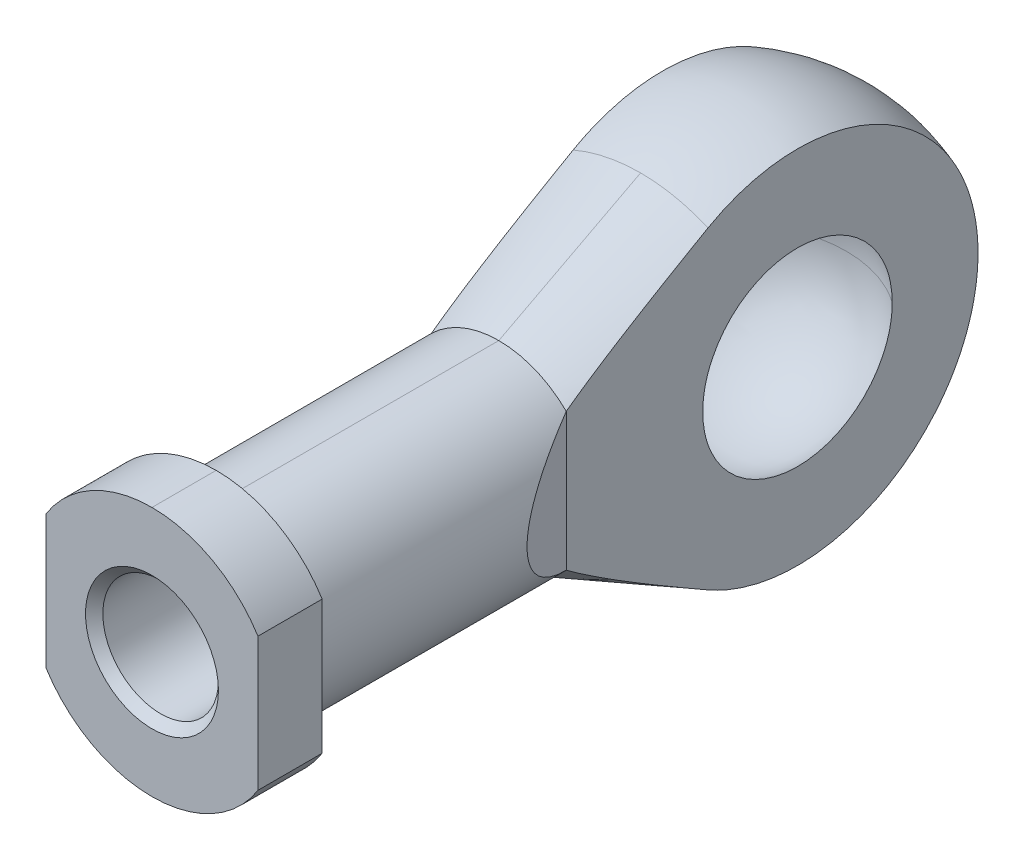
ISO-10303-21;
HEADER;
FILE_DESCRIPTION(('STEP AP214'),'2;1');
FILE_NAME('part.step','',(''),(''),'','','');
FILE_SCHEMA(('AUTOMOTIVE_DESIGN { 1 0 10303 214 1 1 1 1 }'));
ENDSEC;
DATA;
#1=APPLICATION_CONTEXT('core data for automotive mechanical design processes');
#2=APPLICATION_PROTOCOL_DEFINITION('international standard','automotive_design',2000,#1);
#3=PRODUCT_CONTEXT('',#1,'mechanical');
#4=PRODUCT('Part','Part','',(#3));
#5=PRODUCT_RELATED_PRODUCT_CATEGORY('part','',(#4));
#6=PRODUCT_DEFINITION_FORMATION('','',#4);
#7=PRODUCT_DEFINITION_CONTEXT('part definition',#1,'design');
#8=PRODUCT_DEFINITION('design','',#6,#7);
#9=PRODUCT_DEFINITION_SHAPE('','',#8);
#10=(LENGTH_UNIT() NAMED_UNIT(*) SI_UNIT(.MILLI.,.METRE.));
#11=(NAMED_UNIT(*) PLANE_ANGLE_UNIT() SI_UNIT($,.RADIAN.));
#12=(NAMED_UNIT(*) SI_UNIT($,.STERADIAN.) SOLID_ANGLE_UNIT());
#13=UNCERTAINTY_MEASURE_WITH_UNIT(LENGTH_MEASURE(1.E-05),#10,'distance_accuracy_value','');
#14=(GEOMETRIC_REPRESENTATION_CONTEXT(3) GLOBAL_UNCERTAINTY_ASSIGNED_CONTEXT((#13)) GLOBAL_UNIT_ASSIGNED_CONTEXT((#10,
#11,#12)) REPRESENTATION_CONTEXT('',''));
#15=CARTESIAN_POINT('',(0.,0.,0.));
#16=DIRECTION('',(0.,0.,1.));
#17=DIRECTION('',(1.,0.,0.));
#18=AXIS2_PLACEMENT_3D('',#15,#16,#17);
#19=CARTESIAN_POINT('',(0.,3.25,30.));
#20=DIRECTION('',(0.,0.,1.));
#21=DIRECTION('',(1.,0.,0.));
#22=AXIS2_PLACEMENT_3D('',#19,#20,#21);
#23=PLANE('',#22);
#24=CARTESIAN_POINT('',(0.,0.,30.));
#25=DIRECTION('',(0.,0.,1.));
#26=DIRECTION('',(1.,0.,0.));
#27=AXIS2_PLACEMENT_3D('',#24,#25,#26);
#28=CIRCLE('',#27,3.45000000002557);
#29=CARTESIAN_POINT('',(3.45000000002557,0.,30.));
#30=VERTEX_POINT('',#29);
#31=EDGE_CURVE('E23',#30,#30,#28,.F.);
#32=ORIENTED_EDGE('',*,*,#31,.T.);
#33=EDGE_LOOP('',(#32));
#34=FACE_BOUND('',#33,.T.);
#35=CARTESIAN_POINT('',(0.,0.,30.));
#36=DIRECTION('',(0.,0.,1.));
#37=DIRECTION('',(1.,0.,0.));
#38=AXIS2_PLACEMENT_3D('',#35,#36,#37);
#39=CIRCLE('',#38,6.5);
#40=CARTESIAN_POINT('',(0.,6.5,30.));
#41=VERTEX_POINT('',#40);
#42=CARTESIAN_POINT('',(5.5,3.46410161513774,30.));
#43=VERTEX_POINT('',#42);
#44=EDGE_CURVE('E148',#41,#43,#39,.F.);
#45=ORIENTED_EDGE('',*,*,#44,.F.);
#46=CARTESIAN_POINT('',(0.,0.,30.));
#47=DIRECTION('',(0.,0.,1.));
#48=DIRECTION('',(1.,0.,0.));
#49=AXIS2_PLACEMENT_3D('',#46,#47,#48);
#50=CIRCLE('',#49,6.5);
#51=CARTESIAN_POINT('',(-5.5,3.46410161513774,30.));
#52=VERTEX_POINT('',#51);
#53=EDGE_CURVE('E157',#52,#41,#50,.F.);
#54=ORIENTED_EDGE('',*,*,#53,.F.);
#55=DIRECTION('',(0.,1.,0.));
#56=VECTOR('',#55,1.);
#57=CARTESIAN_POINT('',(-5.5,20.,30.));
#58=LINE('',#57,#56);
#59=CARTESIAN_POINT('',(-5.5,-3.46410161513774,30.));
#60=VERTEX_POINT('',#59);
#61=EDGE_CURVE('E164',#52,#60,#58,.F.);
#62=ORIENTED_EDGE('',*,*,#61,.T.);
#63=CARTESIAN_POINT('',(0.,0.,30.));
#64=DIRECTION('',(0.,0.,1.));
#65=DIRECTION('',(1.,0.,0.));
#66=AXIS2_PLACEMENT_3D('',#63,#64,#65);
#67=CIRCLE('',#66,6.5);
#68=CARTESIAN_POINT('',(0.,-6.5,30.));
#69=VERTEX_POINT('',#68);
#70=EDGE_CURVE('E128',#69,#60,#67,.F.);
#71=ORIENTED_EDGE('',*,*,#70,.F.);
#72=CARTESIAN_POINT('',(0.,0.,30.));
#73=DIRECTION('',(0.,0.,1.));
#74=DIRECTION('',(1.,0.,0.));
#75=AXIS2_PLACEMENT_3D('',#72,#73,#74);
#76=CIRCLE('',#75,6.5);
#77=CARTESIAN_POINT('',(5.5,-3.46410161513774,30.));
#78=VERTEX_POINT('',#77);
#79=EDGE_CURVE('E123',#78,#69,#76,.F.);
#80=ORIENTED_EDGE('',*,*,#79,.F.);
#81=DIRECTION('',(0.,1.,0.));
#82=VECTOR('',#81,1.);
#83=CARTESIAN_POINT('',(5.5,20.,30.));
#84=LINE('',#83,#82);
#85=EDGE_CURVE('E126',#78,#43,#84,.T.);
#86=ORIENTED_EDGE('',*,*,#85,.T.);
#87=EDGE_LOOP('',(#45,#54,#62,#71,#80,#86));
#88=FACE_BOUND('',#87,.T.);
#89=ADVANCED_FACE('F14',(#34,#88),#23,.T.);
#90=CARTESIAN_POINT('',(0.,0.,28.3333333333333));
#91=DIRECTION('',(0.,0.,1.));
#92=DIRECTION('',(1.,0.,0.));
#93=AXIS2_PLACEMENT_3D('',#90,#91,#92);
#94=CYLINDRICAL_SURFACE('',#93,6.5);
#95=DIRECTION('',(0.,0.,1.));
#96=VECTOR('',#95,1.);
#97=CARTESIAN_POINT('',(5.5,-3.46410161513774,26.6666666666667));
#98=LINE('',#97,#96);
#99=CARTESIAN_POINT('',(5.5,-3.46410161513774,26.6666666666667));
#100=VERTEX_POINT('',#99);
#101=EDGE_CURVE('E140',#100,#78,#98,.T.);
#102=ORIENTED_EDGE('',*,*,#101,.T.);
#103=ORIENTED_EDGE('',*,*,#79,.T.);
#104=DIRECTION('',(0.,0.,1.));
#105=VECTOR('',#104,1.);
#106=CARTESIAN_POINT('',(0.,-6.5,28.3333333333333));
#107=LINE('',#106,#105);
#108=CARTESIAN_POINT('',(0.,-6.5,26.6666666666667));
#109=VERTEX_POINT('',#108);
#110=EDGE_CURVE('E133',#109,#69,#107,.T.);
#111=ORIENTED_EDGE('',*,*,#110,.F.);
#112=CARTESIAN_POINT('',(0.,0.,26.6666666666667));
#113=DIRECTION('',(0.,0.,1.));
#114=DIRECTION('',(1.,0.,0.));
#115=AXIS2_PLACEMENT_3D('',#112,#113,#114);
#116=CIRCLE('',#115,6.5);
#117=EDGE_CURVE('E147',#100,#109,#116,.F.);
#118=ORIENTED_EDGE('',*,*,#117,.F.);
#119=EDGE_LOOP('',(#102,#103,#111,#118));
#120=FACE_BOUND('',#119,.T.);
#121=ADVANCED_FACE('F146',(#120),#94,.T.);
#122=CARTESIAN_POINT('',(0.,0.,28.3333333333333));
#123=DIRECTION('',(0.,0.,1.));
#124=DIRECTION('',(1.,0.,0.));
#125=AXIS2_PLACEMENT_3D('',#122,#123,#124);
#126=CYLINDRICAL_SURFACE('',#125,6.5);
#127=DIRECTION('',(0.,0.,-1.));
#128=VECTOR('',#127,1.);
#129=CARTESIAN_POINT('',(-5.5,-3.46410161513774,50.));
#130=LINE('',#129,#128);
#131=CARTESIAN_POINT('',(-5.5,-3.46410161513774,26.6666666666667));
#132=VERTEX_POINT('',#131);
#133=EDGE_CURVE('E161',#60,#132,#130,.T.);
#134=ORIENTED_EDGE('',*,*,#133,.T.);
#135=CARTESIAN_POINT('',(0.,0.,26.6666666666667));
#136=DIRECTION('',(0.,0.,1.));
#137=DIRECTION('',(1.,0.,0.));
#138=AXIS2_PLACEMENT_3D('',#135,#136,#137);
#139=CIRCLE('',#138,6.5);
#140=EDGE_CURVE('E494',#109,#132,#139,.F.);
#141=ORIENTED_EDGE('',*,*,#140,.F.);
#142=ORIENTED_EDGE('',*,*,#110,.T.);
#143=ORIENTED_EDGE('',*,*,#70,.T.);
#144=EDGE_LOOP('',(#134,#141,#142,#143));
#145=FACE_BOUND('',#144,.T.);
#146=ADVANCED_FACE('F511',(#145),#126,.T.);
#147=CARTESIAN_POINT('',(-5.5,20.,50.));
#148=DIRECTION('',(1.,0.,0.));
#149=DIRECTION('',(0.,0.,-1.));
#150=AXIS2_PLACEMENT_3D('',#147,#148,#149);
#151=PLANE('',#150);
#152=ORIENTED_EDGE('',*,*,#61,.F.);
#153=DIRECTION('',(0.,0.,1.));
#154=VECTOR('',#153,1.);
#155=CARTESIAN_POINT('',(-5.5,3.46410161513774,28.3333333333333));
#156=LINE('',#155,#154);
#157=CARTESIAN_POINT('',(-5.5,3.46410161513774,26.6666666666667));
#158=VERTEX_POINT('',#157);
#159=EDGE_CURVE('E158',#158,#52,#156,.T.);
#160=ORIENTED_EDGE('',*,*,#159,.F.);
#161=DIRECTION('',(0.,1.,0.));
#162=VECTOR('',#161,1.);
#163=CARTESIAN_POINT('',(-5.5,5.75,26.6666666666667));
#164=LINE('',#163,#162);
#165=EDGE_CURVE('E493',#132,#158,#164,.T.);
#166=ORIENTED_EDGE('',*,*,#165,.F.);
#167=ORIENTED_EDGE('',*,*,#133,.F.);
#168=EDGE_LOOP('',(#152,#160,#166,#167));
#169=FACE_BOUND('',#168,.T.);
#170=ADVANCED_FACE('F516',(#169),#151,.F.);
#171=CARTESIAN_POINT('',(0.,0.,28.3333333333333));
#172=DIRECTION('',(0.,0.,1.));
#173=DIRECTION('',(1.,0.,0.));
#174=AXIS2_PLACEMENT_3D('',#171,#172,#173);
#175=CYLINDRICAL_SURFACE('',#174,6.5);
#176=ORIENTED_EDGE('',*,*,#159,.T.);
#177=ORIENTED_EDGE('',*,*,#53,.T.);
#178=DIRECTION('',(0.,0.,1.));
#179=VECTOR('',#178,1.);
#180=CARTESIAN_POINT('',(0.,6.5,28.3333333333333));
#181=LINE('',#180,#179);
#182=CARTESIAN_POINT('',(0.,6.5,26.6666666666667));
#183=VERTEX_POINT('',#182);
#184=EDGE_CURVE('E150',#183,#41,#181,.T.);
#185=ORIENTED_EDGE('',*,*,#184,.F.);
#186=CARTESIAN_POINT('',(0.,0.,26.6666666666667));
#187=DIRECTION('',(0.,0.,1.));
#188=DIRECTION('',(1.,0.,0.));
#189=AXIS2_PLACEMENT_3D('',#186,#187,#188);
#190=CIRCLE('',#189,6.5);
#191=EDGE_CURVE('E491',#158,#183,#190,.F.);
#192=ORIENTED_EDGE('',*,*,#191,.F.);
#193=EDGE_LOOP('',(#176,#177,#185,#192));
#194=FACE_BOUND('',#193,.T.);
#195=ADVANCED_FACE('F520',(#194),#175,.T.);
#196=CARTESIAN_POINT('',(0.,0.,28.3333333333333));
#197=DIRECTION('',(0.,0.,1.));
#198=DIRECTION('',(1.,0.,0.));
#199=AXIS2_PLACEMENT_3D('',#196,#197,#198);
#200=CYLINDRICAL_SURFACE('',#199,6.5);
#201=DIRECTION('',(0.,0.,1.));
#202=VECTOR('',#201,1.);
#203=CARTESIAN_POINT('',(5.5,3.46410161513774,26.6666666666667));
#204=LINE('',#203,#202);
#205=CARTESIAN_POINT('',(5.5,3.46410161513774,26.6666666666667));
#206=VERTEX_POINT('',#205);
#207=EDGE_CURVE('E143',#43,#206,#204,.F.);
#208=ORIENTED_EDGE('',*,*,#207,.T.);
#209=CARTESIAN_POINT('',(0.,0.,26.6666666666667));
#210=DIRECTION('',(0.,0.,1.));
#211=DIRECTION('',(1.,0.,0.));
#212=AXIS2_PLACEMENT_3D('',#209,#210,#211);
#213=CIRCLE('',#212,6.5);
#214=EDGE_CURVE('E489',#183,#206,#213,.F.);
#215=ORIENTED_EDGE('',*,*,#214,.F.);
#216=ORIENTED_EDGE('',*,*,#184,.T.);
#217=ORIENTED_EDGE('',*,*,#44,.T.);
#218=EDGE_LOOP('',(#208,#215,#216,#217));
#219=FACE_BOUND('',#218,.T.);
#220=ADVANCED_FACE('F524',(#219),#200,.T.);
#221=CARTESIAN_POINT('',(5.5,20.,26.6666666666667));
#222=DIRECTION('',(-1.,0.,0.));
#223=DIRECTION('',(0.,0.,1.));
#224=AXIS2_PLACEMENT_3D('',#221,#222,#223);
#225=PLANE('',#224);
#226=ORIENTED_EDGE('',*,*,#85,.F.);
#227=ORIENTED_EDGE('',*,*,#101,.F.);
#228=DIRECTION('',(0.,1.,0.));
#229=VECTOR('',#228,1.);
#230=CARTESIAN_POINT('',(5.5,5.75,26.6666666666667));
#231=LINE('',#230,#229);
#232=EDGE_CURVE('E412',#206,#100,#231,.F.);
#233=ORIENTED_EDGE('',*,*,#232,.F.);
#234=ORIENTED_EDGE('',*,*,#207,.F.);
#235=EDGE_LOOP('',(#226,#227,#233,#234));
#236=FACE_BOUND('',#235,.T.);
#237=ADVANCED_FACE('F138',(#236),#225,.F.);
#238=CARTESIAN_POINT('',(3.5,20.,12.));
#239=DIRECTION('',(-0.92050485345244,0.,0.390731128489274));
#240=DIRECTION('',(0.390731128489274,0.,0.92050485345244));
#241=AXIS2_PLACEMENT_3D('',#238,#239,#240);
#242=PLANE('',#241);
#243=DIRECTION('',(0.,1.,0.));
#244=VECTOR('',#243,1.);
#245=CARTESIAN_POINT('',(3.5,20.,12.));
#246=LINE('',#245,#244);
#247=CARTESIAN_POINT('',(3.50000000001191,-3.57071421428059,12.0000000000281));
#248=VERTEX_POINT('',#247);
#249=CARTESIAN_POINT('',(3.50000000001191,3.57071421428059,12.0000000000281));
#250=VERTEX_POINT('',#249);
#251=EDGE_CURVE('E387',#248,#250,#246,.T.);
#252=ORIENTED_EDGE('',*,*,#251,.T.);
#253=CARTESIAN_POINT('',(0.,0.,3.75451671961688));
#254=DIRECTION('',(-0.92050485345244,0.,0.390731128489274));
#255=DIRECTION('',(0.390731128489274,0.,0.92050485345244));
#256=AXIS2_PLACEMENT_3D('',#253,#254,#255);
#257=ELLIPSE('',#256,12.7965233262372,5.);
#258=EDGE_CURVE('E499',#248,#250,#257,.T.);
#259=ORIENTED_EDGE('',*,*,#258,.F.);
#260=EDGE_LOOP('',(#252,#259));
#261=FACE_BOUND('',#260,.T.);
#262=ADVANCED_FACE('F531',(#261),#242,.F.);
#263=CARTESIAN_POINT('',(0.,0.,19.3333333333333));
#264=DIRECTION('',(0.,0.,1.));
#265=DIRECTION('',(1.,0.,0.));
#266=AXIS2_PLACEMENT_3D('',#263,#264,#265);
#267=CYLINDRICAL_SURFACE('',#266,5.);
#268=ORIENTED_EDGE('',*,*,#258,.T.);
#269=CARTESIAN_POINT('',(0.,0.,12.0000000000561));
#270=DIRECTION('',(0.,0.,-1.));
#271=DIRECTION('',(0.,1.,0.));
#272=AXIS2_PLACEMENT_3D('',#269,#270,#271);
#273=CIRCLE('',#272,5.00000000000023);
#274=CARTESIAN_POINT('',(0.,5.0000000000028,12.0000000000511));
#275=VERTEX_POINT('',#274);
#276=EDGE_CURVE('E381',#275,#250,#273,.T.);
#277=ORIENTED_EDGE('',*,*,#276,.F.);
#278=DIRECTION('',(0.,0.,1.));
#279=VECTOR('',#278,1.);
#280=CARTESIAN_POINT('',(0.,5.,19.3333333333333));
#281=LINE('',#280,#279);
#282=CARTESIAN_POINT('',(0.,5.,26.6666666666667));
#283=VERTEX_POINT('',#282);
#284=EDGE_CURVE('E366',#283,#275,#281,.F.);
#285=ORIENTED_EDGE('',*,*,#284,.F.);
#286=CARTESIAN_POINT('',(0.,0.,26.6666666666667));
#287=DIRECTION('',(0.,0.,1.));
#288=DIRECTION('',(1.,0.,0.));
#289=AXIS2_PLACEMENT_3D('',#286,#287,#288);
#290=CIRCLE('',#289,5.);
#291=CARTESIAN_POINT('',(0.,-5.,26.6666666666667));
#292=VERTEX_POINT('',#291);
#293=EDGE_CURVE('E497',#292,#283,#290,.T.);
#294=ORIENTED_EDGE('',*,*,#293,.F.);
#295=DIRECTION('',(0.,0.,1.));
#296=VECTOR('',#295,1.);
#297=CARTESIAN_POINT('',(0.,-5.,19.3333333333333));
#298=LINE('',#297,#296);
#299=CARTESIAN_POINT('',(0.,-5.0000000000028,12.0000000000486));
#300=VERTEX_POINT('',#299);
#301=EDGE_CURVE('E374',#300,#292,#298,.T.);
#302=ORIENTED_EDGE('',*,*,#301,.F.);
#303=CARTESIAN_POINT('',(0.,0.,12.0000000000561));
#304=DIRECTION('',(0.,0.,-1.));
#305=DIRECTION('',(0.,1.,0.));
#306=AXIS2_PLACEMENT_3D('',#303,#304,#305);
#307=CIRCLE('',#306,5.00000000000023);
#308=EDGE_CURVE('E390',#248,#300,#307,.T.);
#309=ORIENTED_EDGE('',*,*,#308,.F.);
#310=EDGE_LOOP('',(#268,#277,#285,#294,#302,#309));
#311=FACE_BOUND('',#310,.T.);
#312=ADVANCED_FACE('F534',(#311),#267,.T.);
#313=CARTESIAN_POINT('',(0.,5.75,26.6666666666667));
#314=DIRECTION('',(0.,0.,-1.));
#315=DIRECTION('',(-1.,0.,0.));
#316=AXIS2_PLACEMENT_3D('',#313,#314,#315);
#317=PLANE('',#316);
#318=ORIENTED_EDGE('',*,*,#214,.T.);
#319=ORIENTED_EDGE('',*,*,#232,.T.);
#320=ORIENTED_EDGE('',*,*,#117,.T.);
#321=ORIENTED_EDGE('',*,*,#140,.T.);
#322=ORIENTED_EDGE('',*,*,#165,.T.);
#323=ORIENTED_EDGE('',*,*,#191,.T.);
#324=EDGE_LOOP('',(#318,#319,#320,#321,#322,#323));
#325=FACE_BOUND('',#324,.T.);
#326=ORIENTED_EDGE('',*,*,#293,.T.);
#327=CARTESIAN_POINT('',(0.,0.,26.6666666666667));
#328=DIRECTION('',(0.,0.,1.));
#329=DIRECTION('',(1.,0.,0.));
#330=AXIS2_PLACEMENT_3D('',#327,#328,#329);
#331=CIRCLE('',#330,5.);
#332=EDGE_CURVE('E407',#292,#283,#331,.F.);
#333=ORIENTED_EDGE('',*,*,#332,.F.);
#334=EDGE_LOOP('',(#326,#333));
#335=FACE_BOUND('',#334,.T.);
#336=ADVANCED_FACE('F537',(#325,#335),#317,.T.);
#337=CARTESIAN_POINT('',(0.,0.,4.6430106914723));
#338=DIRECTION('',(0.,0.,-1.));
#339=DIRECTION('',(-1.,0.,0.));
#340=AXIS2_PLACEMENT_3D('',#337,#338,#339);
#341=CONICAL_SURFACE('',#340,8.85677434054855,0.482845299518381);
#342=CARTESIAN_POINT('',(3.5,-8.13587436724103,4.64301069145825));
#343=CARTESIAN_POINT('',(3.5,-7.95695905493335,4.95648115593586));
#344=CARTESIAN_POINT('',(3.5,-7.77738032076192,5.26957580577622));
#345=CARTESIAN_POINT('',(3.5,-7.41652885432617,5.89478152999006));
#346=CARTESIAN_POINT('',(3.5,-7.23525614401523,6.20689261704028));
#347=CARTESIAN_POINT('',(3.5,-6.87076094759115,6.82970920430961));
#348=CARTESIAN_POINT('',(3.5,-6.68753977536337,7.1404154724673));
#349=CARTESIAN_POINT('',(3.5,-6.31850170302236,7.76029957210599));
#350=CARTESIAN_POINT('',(3.5,-6.13268471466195,8.06947735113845));
#351=CARTESIAN_POINT('',(3.5,-5.7576384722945,8.6859952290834));
#352=CARTESIAN_POINT('',(3.5,-5.56840737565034,8.99333420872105));
#353=CARTESIAN_POINT('',(3.5,-5.18563345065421,9.60528959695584));
#354=CARTESIAN_POINT('',(3.5,-4.99209101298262,9.90990624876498));
#355=CARTESIAN_POINT('',(3.5,-4.69732002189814,10.3640843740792));
#356=CARTESIAN_POINT('',(3.5,-4.59828584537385,10.5150699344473));
#357=CARTESIAN_POINT('',(3.5,-4.39848032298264,10.8158829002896));
#358=CARTESIAN_POINT('',(3.5,-4.29770902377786,10.9657103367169));
#359=CARTESIAN_POINT('',(3.5,-4.09407567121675,11.2640077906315));
#360=CARTESIAN_POINT('',(3.5,-3.99121300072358,11.4124773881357));
#361=CARTESIAN_POINT('',(3.5,-3.78296572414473,11.7076558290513));
#362=CARTESIAN_POINT('',(3.5,-3.67758088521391,11.8543645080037));
#363=CARTESIAN_POINT('',(3.5,-3.57071421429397,12.0000000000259));
#364=B_SPLINE_CURVE_WITH_KNOTS('',3,(#342,#343,#344,#345,#346,#347,#348,#349,#350,#351,#352,
#353,#354,#355,#356,#357,#358,#359,#360,#361,#362,#363),.UNSPECIFIED.,.F.,.F.,(4,2,2,2,2,2,2,2,
2,2,4),(0.,1.08280934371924,2.16560467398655,3.24771109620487,4.32985439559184,5.41260033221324,
6.49524854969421,7.03693963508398,7.57861619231,8.12045498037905,8.6623439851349),.UNSPECIFIED.);
#365=CARTESIAN_POINT('',(3.5,-8.13587436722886,4.6430106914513));
#366=VERTEX_POINT('',#365);
#367=EDGE_CURVE('E384',#366,#248,#364,.T.);
#368=ORIENTED_EDGE('',*,*,#367,.T.);
#369=ORIENTED_EDGE('',*,*,#308,.T.);
#370=DIRECTION('',(0.,0.464301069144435,0.885677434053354));
#371=VECTOR('',#370,1.);
#372=CARTESIAN_POINT('',(-3.2036119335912E-11,-261603.406155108,-499000.));
#373=LINE('',#372,#371);
#374=CARTESIAN_POINT('',(0.,-8.8567743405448,4.64301069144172));
#375=VERTEX_POINT('',#374);
#376=EDGE_CURVE('E236',#375,#300,#373,.T.);
#377=ORIENTED_EDGE('',*,*,#376,.F.);
#378=CARTESIAN_POINT('',(0.,0.,4.64301069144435));
#379=DIRECTION('',(0.,0.,1.));
#380=DIRECTION('',(0.,1.,0.));
#381=AXIS2_PLACEMENT_3D('',#378,#379,#380);
#382=CIRCLE('',#381,8.85677434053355);
#383=EDGE_CURVE('E226',#366,#375,#382,.F.);
#384=ORIENTED_EDGE('',*,*,#383,.F.);
#385=EDGE_LOOP('',(#368,#369,#377,#384));
#386=FACE_BOUND('',#385,.T.);
#387=ADVANCED_FACE('F444',(#386),#341,.T.);
#388=CARTESIAN_POINT('',(3.5,20.,-18.));
#389=DIRECTION('',(-1.,0.,0.));
#390=DIRECTION('',(0.,0.,1.));
#391=AXIS2_PLACEMENT_3D('',#388,#389,#390);
#392=PLANE('',#391);
#393=CARTESIAN_POINT('',(3.5,0.,-9.3674969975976));
#394=CARTESIAN_POINT('',(3.5,-0.263464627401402,-9.3675253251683));
#395=CARTESIAN_POINT('',(3.5,-0.526925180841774,-9.35638311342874));
#396=CARTESIAN_POINT('',(3.5,-1.05196139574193,-9.31196221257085));
#397=CARTESIAN_POINT('',(3.5,-1.31353714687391,-9.27868458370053));
#398=CARTESIAN_POINT('',(3.5,-1.83276844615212,-9.1902287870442));
#399=CARTESIAN_POINT('',(3.5,-2.09042664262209,-9.13506616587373));
#400=CARTESIAN_POINT('',(3.5,-2.6001796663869,-9.00324170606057));
#401=CARTESIAN_POINT('',(3.5,-2.85227456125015,-8.92658012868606));
#402=CARTESIAN_POINT('',(3.5,-3.34922818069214,-8.75225930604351));
#403=CARTESIAN_POINT('',(3.5,-3.59408350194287,-8.65459035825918));
#404=CARTESIAN_POINT('',(3.5,-4.07470012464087,-8.4389685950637));
#405=CARTESIAN_POINT('',(3.5,-4.31046123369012,-8.32101535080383));
#406=CARTESIAN_POINT('',(3.5,-4.77116061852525,-8.06569098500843));
#407=CARTESIAN_POINT('',(3.5,-4.99610108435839,-7.92832381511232));
#408=CARTESIAN_POINT('',(3.5,-5.43361055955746,-7.63513065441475));
#409=CARTESIAN_POINT('',(3.5,-5.64617962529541,-7.47930474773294));
#410=CARTESIAN_POINT('',(3.5,-6.05744041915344,-7.15029804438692));
#411=CARTESIAN_POINT('',(3.5,-6.25613188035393,-6.97711691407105));
#412=CARTESIAN_POINT('',(3.5,-6.63822057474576,-6.61463333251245));
#413=CARTESIAN_POINT('',(3.5,-6.82161781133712,-6.42533088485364));
#414=CARTESIAN_POINT('',(3.5,-7.17184281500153,-6.03191839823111));
#415=CARTESIAN_POINT('',(3.5,-7.33866789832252,-5.82780597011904));
#416=CARTESIAN_POINT('',(3.5,-7.65452858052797,-5.4062520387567));
#417=CARTESIAN_POINT('',(3.5,-7.80356418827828,-5.18881054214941));
#418=CARTESIAN_POINT('',(3.5,-8.08278511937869,-4.74214639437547));
#419=CARTESIAN_POINT('',(3.5,-8.21297060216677,-4.51292384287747));
#420=CARTESIAN_POINT('',(3.5,-8.45356710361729,-4.04432576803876));
#421=CARTESIAN_POINT('',(3.5,-8.56397812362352,-3.80495024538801));
#422=CARTESIAN_POINT('',(3.5,-8.76422635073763,-3.31778305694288));
#423=CARTESIAN_POINT('',(3.5,-8.85406648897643,-3.06999259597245));
#424=CARTESIAN_POINT('',(3.5,-9.01255430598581,-2.56772514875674));
#425=CARTESIAN_POINT('',(3.5,-9.08120203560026,-2.31324817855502));
#426=CARTESIAN_POINT('',(3.5,-9.19680813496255,-1.79945703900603));
#427=CARTESIAN_POINT('',(3.5,-9.24376995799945,-1.54014364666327));
#428=CARTESIAN_POINT('',(3.5,-9.31568667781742,-1.01848281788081));
#429=CARTESIAN_POINT('',(3.5,-9.3406415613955,-0.756135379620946));
#430=CARTESIAN_POINT('',(3.5,-9.3683737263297,-0.230143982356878));
#431=CARTESIAN_POINT('',(3.5,-9.37114030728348,0.0335005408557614));
#432=CARTESIAN_POINT('',(3.5,-9.35444826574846,0.560075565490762));
#433=CARTESIAN_POINT('',(3.5,-9.33499045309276,0.823006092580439));
#434=CARTESIAN_POINT('',(3.5,-9.27396531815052,1.34650195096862));
#435=CARTESIAN_POINT('',(3.5,-9.23238027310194,1.60706521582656));
#436=CARTESIAN_POINT('',(3.5,-9.1273857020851,2.12375149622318));
#437=CARTESIAN_POINT('',(3.5,-9.06397685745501,2.37987465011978));
#438=CARTESIAN_POINT('',(3.5,-8.9159184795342,2.88542342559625));
#439=CARTESIAN_POINT('',(3.5,-8.83130506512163,3.13485964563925));
#440=CARTESIAN_POINT('',(3.5,-8.64141517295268,3.62561722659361));
#441=CARTESIAN_POINT('',(3.5,-8.5361507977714,3.86694324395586));
#442=CARTESIAN_POINT('',(3.5,-8.37636289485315,4.19486869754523));
#443=CARTESIAN_POINT('',(3.5,-8.33027802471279,4.28565484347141));
#444=CARTESIAN_POINT('',(3.5,-8.23523218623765,4.46556629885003));
#445=CARTESIAN_POINT('',(3.5,-8.18627482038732,4.55469351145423));
#446=CARTESIAN_POINT('',(3.5,-8.13587436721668,4.64301069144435));
#447=B_SPLINE_CURVE_WITH_KNOTS('',3,(#393,#394,#395,#396,#397,#398,#399,#400,#401,#402,#403,
#404,#405,#406,#407,#408,#409,#410,#411,#412,#413,#414,#415,#416,#417,#418,#419,#420,#421,#422,
#423,#424,#425,#426,#427,#428,#429,#430,#431,#432,#433,#434,#435,#436,#437,#438,#439,#440,#441,
#442,#443,#444,#445,#446),.UNSPECIFIED.,.F.,.F.,(4,2,2,2,2,2,2,2,2,2,2,2,2,2,2,2,2,2,2,2,2,2,2,
2,2,2,4),(0.,0.79015262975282,1.58026741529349,2.36982192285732,3.15936683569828,
3.94927719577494,4.73920425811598,5.52897076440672,6.31873367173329,7.10851176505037,
7.89828968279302,8.68819529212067,9.47810050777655,10.2679990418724,11.0578975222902,
11.8476833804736,12.6374673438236,13.4271254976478,14.2167841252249,15.0068235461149,
15.7968341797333,16.5874785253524,17.3780981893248,18.1673801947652,18.9562010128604,
19.2615985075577,19.5666208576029),.UNSPECIFIED.);
#448=CARTESIAN_POINT('',(3.5,0.,-9.3674969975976));
#449=VERTEX_POINT('',#448);
#450=EDGE_CURVE('E231',#449,#366,#447,.T.);
#451=ORIENTED_EDGE('',*,*,#450,.F.);
#452=CARTESIAN_POINT('',(3.5,8.13587436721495,4.64301069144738));
#453=CARTESIAN_POINT('',(3.5,8.26648551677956,4.41419998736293));
#454=CARTESIAN_POINT('',(3.5,8.38739279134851,4.17985613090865));
#455=CARTESIAN_POINT('',(3.5,8.60904708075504,3.70183351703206));
#456=CARTESIAN_POINT('',(3.5,8.70979506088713,3.45815520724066));
#457=CARTESIAN_POINT('',(3.5,8.89032687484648,2.9633483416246));
#458=CARTESIAN_POINT('',(3.5,8.97012552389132,2.71222519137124));
#459=CARTESIAN_POINT('',(3.5,9.10829279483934,2.20415468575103));
#460=CARTESIAN_POINT('',(3.5,9.16666167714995,1.94720740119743));
#461=CARTESIAN_POINT('',(3.5,9.26157589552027,1.42919008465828));
#462=CARTESIAN_POINT('',(3.5,9.29811111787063,1.16811819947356));
#463=CARTESIAN_POINT('',(3.5,9.34905712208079,0.643819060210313));
#464=CARTESIAN_POINT('',(3.5,9.36346743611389,0.38059176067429));
#465=CARTESIAN_POINT('',(3.5,9.37005886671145,-0.146087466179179));
#466=CARTESIAN_POINT('',(3.5,9.36224450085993,-0.409539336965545));
#467=CARTESIAN_POINT('',(3.5,9.32445195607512,-0.934847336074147));
#468=CARTESIAN_POINT('',(3.5,9.29447387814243,-1.19670347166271));
#469=CARTESIAN_POINT('',(3.5,9.21256630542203,-1.71696494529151));
#470=CARTESIAN_POINT('',(3.5,9.16063638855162,-1.97537021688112));
#471=CARTESIAN_POINT('',(3.5,9.03519423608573,-2.48688794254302));
#472=CARTESIAN_POINT('',(3.5,8.96168200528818,-2.74000039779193));
#473=CARTESIAN_POINT('',(3.5,8.7935841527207,-3.23917376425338));
#474=CARTESIAN_POINT('',(3.5,8.69899512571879,-3.48523352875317));
#475=CARTESIAN_POINT('',(3.5,8.48942310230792,-3.96850907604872));
#476=CARTESIAN_POINT('',(3.5,8.37444011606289,-4.20572486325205));
#477=CARTESIAN_POINT('',(3.5,8.12489879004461,-4.66962389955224));
#478=CARTESIAN_POINT('',(3.5,7.99034061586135,-4.89630723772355));
#479=CARTESIAN_POINT('',(3.5,7.70260495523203,-5.33753169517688));
#480=CARTESIAN_POINT('',(3.5,7.54942747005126,-5.55207281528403));
#481=CARTESIAN_POINT('',(3.5,7.22556546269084,-5.96745772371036));
#482=CARTESIAN_POINT('',(3.5,7.05488343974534,-6.16830346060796));
#483=CARTESIAN_POINT('',(3.5,6.69720793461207,-6.55490300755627));
#484=CARTESIAN_POINT('',(3.5,6.51021449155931,-6.740656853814));
#485=CARTESIAN_POINT('',(3.5,6.12127603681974,-7.09572443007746));
#486=CARTESIAN_POINT('',(3.5,5.91933341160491,-7.26504077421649));
#487=CARTESIAN_POINT('',(3.5,5.50190526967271,-7.58606379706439));
#488=CARTESIAN_POINT('',(3.5,5.2864197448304,-7.73777046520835));
#489=CARTESIAN_POINT('',(3.5,4.84333028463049,-8.022564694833));
#490=CARTESIAN_POINT('',(3.5,4.61572055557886,-8.15564324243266));
#491=CARTESIAN_POINT('',(3.5,4.15010529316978,-8.40214336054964));
#492=CARTESIAN_POINT('',(3.5,3.91210013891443,-8.5155656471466));
#493=CARTESIAN_POINT('',(3.5,3.42718545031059,-8.72203531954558));
#494=CARTESIAN_POINT('',(3.5,3.18026892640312,-8.81506628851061));
#495=CARTESIAN_POINT('',(3.5,2.67947500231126,-8.97997237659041));
#496=CARTESIAN_POINT('',(3.5,2.42559781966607,-9.05184815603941));
#497=CARTESIAN_POINT('',(3.5,1.91313243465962,-9.17383207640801));
#498=CARTESIAN_POINT('',(3.5,1.65455292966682,-9.22397684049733));
#499=CARTESIAN_POINT('',(3.5,1.13420017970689,-9.3022979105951));
#500=CARTESIAN_POINT('',(3.5,0.87242888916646,-9.33048703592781));
#501=CARTESIAN_POINT('',(3.5,0.508419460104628,-9.35424440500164));
#502=CARTESIAN_POINT('',(3.5,0.406727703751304,-9.35921695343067));
#503=CARTESIAN_POINT('',(3.5,0.203361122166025,-9.36584090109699));
#504=CARTESIAN_POINT('',(3.5,0.101686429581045,-9.36749637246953));
#505=CARTESIAN_POINT('',(3.5,0.,-9.3674969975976));
#506=B_SPLINE_CURVE_WITH_KNOTS('',3,(#452,#453,#454,#455,#456,#457,#458,#459,#460,#461,#462,
#463,#464,#465,#466,#467,#468,#469,#470,#471,#472,#473,#474,#475,#476,#477,#478,#479,#480,#481,
#482,#483,#484,#485,#486,#487,#488,#489,#490,#491,#492,#493,#494,#495,#496,#497,#498,#499,#500,
#501,#502,#503,#504,#505),.UNSPECIFIED.,.F.,.F.,(4,2,2,2,2,2,2,2,2,2,2,2,2,2,2,2,2,2,2,2,2,2,2,
2,2,2,4),(0.,0.79015262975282,1.58026741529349,2.36982192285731,3.15936683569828,
3.94927719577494,4.73920425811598,5.52897076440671,6.31873367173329,7.10851176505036,
7.89828968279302,8.68819529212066,9.47810050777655,10.2679990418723,11.0578975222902,
11.8476833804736,12.6374673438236,13.4271254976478,14.2167841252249,15.0068235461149,
15.7968341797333,16.5874785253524,17.3780981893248,18.1673801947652,18.9562010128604,
19.2615985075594,19.5666208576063),.UNSPECIFIED.);
#507=CARTESIAN_POINT('',(3.5,8.13587436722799,4.64301069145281));
#508=VERTEX_POINT('',#507);
#509=EDGE_CURVE('E205',#508,#449,#506,.T.);
#510=ORIENTED_EDGE('',*,*,#509,.F.);
#511=CARTESIAN_POINT('',(3.5,3.5707142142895,12.0000000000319));
#512=CARTESIAN_POINT('',(3.5,3.6552115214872,11.8848693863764));
#513=CARTESIAN_POINT('',(3.5,3.73877280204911,11.7690579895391));
#514=CARTESIAN_POINT('',(3.5,3.90425735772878,11.5362796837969));
#515=CARTESIAN_POINT('',(3.5,3.98618072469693,11.4193128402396));
#516=CARTESIAN_POINT('',(3.5,4.14861607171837,11.1844411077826));
#517=CARTESIAN_POINT('',(3.5,4.22912834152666,11.066536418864));
#518=CARTESIAN_POINT('',(3.5,4.38894146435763,10.8299070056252));
#519=CARTESIAN_POINT('',(3.5,4.46824229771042,10.7111822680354));
#520=CARTESIAN_POINT('',(3.5,4.70448572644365,10.3540832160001));
#521=CARTESIAN_POINT('',(3.5,4.85985104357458,10.1146650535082));
#522=CARTESIAN_POINT('',(3.5,5.16732449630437,9.63373326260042));
#523=CARTESIAN_POINT('',(3.5,5.31943242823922,9.39221950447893));
#524=CARTESIAN_POINT('',(3.5,5.62093767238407,8.90776056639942));
#525=CARTESIAN_POINT('',(3.5,5.77033694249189,8.66481660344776));
#526=CARTESIAN_POINT('',(3.5,6.06703068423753,8.17765630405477));
#527=CARTESIAN_POINT('',(3.5,6.21432520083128,7.93343999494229));
#528=CARTESIAN_POINT('',(3.5,6.6536750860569,7.19919871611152));
#529=CARTESIAN_POINT('',(3.5,6.94316273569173,6.70763654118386));
#530=CARTESIAN_POINT('',(3.5,7.30632914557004,6.08407882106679));
#531=CARTESIAN_POINT('',(3.5,7.38223145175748,5.95336899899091));
#532=CARTESIAN_POINT('',(3.5,7.53372072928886,5.69177213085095));
#533=CARTESIAN_POINT('',(3.5,7.60930771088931,5.56088509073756));
#534=CARTESIAN_POINT('',(3.5,7.76020914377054,5.2989229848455));
#535=CARTESIAN_POINT('',(3.5,7.83552354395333,5.16784788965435));
#536=CARTESIAN_POINT('',(3.5,7.98589051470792,4.90554182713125));
#537=CARTESIAN_POINT('',(3.5,8.06094307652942,4.77431085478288));
#538=CARTESIAN_POINT('',(3.5,8.1358743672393,4.64301069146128));
#539=B_SPLINE_CURVE_WITH_KNOTS('',3,(#511,#512,#513,#514,#515,#516,#517,#518,#519,#520,#521,
#522,#523,#524,#525,#526,#527,#528,#529,#530,#531,#532,#533,#534,#535,#536,#537,#538),
.UNSPECIFIED.,.F.,.F.,(4,2,2,2,2,2,2,2,2,2,2,2,2,4),(0.,0.428419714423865,0.856815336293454,
1.28512193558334,1.7134354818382,2.56962942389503,3.42587674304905,4.28147825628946,
5.13706146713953,6.84842231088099,7.3018715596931,7.75530594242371,8.20882132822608,
8.66235172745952),.UNSPECIFIED.);
#540=EDGE_CURVE('E375',#250,#508,#539,.T.);
#541=ORIENTED_EDGE('',*,*,#540,.F.);
#542=ORIENTED_EDGE('',*,*,#251,.F.);
#543=ORIENTED_EDGE('',*,*,#367,.F.);
#544=EDGE_LOOP('',(#451,#510,#541,#542,#543));
#545=FACE_BOUND('',#544,.T.);
#546=CARTESIAN_POINT('',(3.5,0.,-4.91642400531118));
#547=CARTESIAN_POINT('',(3.5,-0.138275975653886,-4.91643887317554));
#548=CARTESIAN_POINT('',(3.5,-0.276549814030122,-4.91059104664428));
#549=CARTESIAN_POINT('',(3.5,-0.552108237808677,-4.88727738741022));
#550=CARTESIAN_POINT('',(3.5,-0.689392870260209,-4.86981211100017));
#551=CARTESIAN_POINT('',(3.5,-0.961905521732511,-4.8233872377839));
#552=CARTESIAN_POINT('',(3.5,-1.0971349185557,-4.79443572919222));
#553=CARTESIAN_POINT('',(3.5,-1.36467383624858,-4.72524901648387));
#554=CARTESIAN_POINT('',(3.5,-1.49698339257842,-4.68501394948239));
#555=CARTESIAN_POINT('',(3.5,-1.75778161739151,-4.59353145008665));
#556=CARTESIAN_POINT('',(3.5,-1.88626918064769,-4.54228086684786));
#557=CARTESIAN_POINT('',(3.5,-2.13851721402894,-4.42911782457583));
#558=CARTESIAN_POINT('',(3.5,-2.2622759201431,-4.36720143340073));
#559=CARTESIAN_POINT('',(3.5,-2.50406719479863,-4.23319816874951));
#560=CARTESIAN_POINT('',(3.5,-2.62210296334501,-4.16111706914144));
#561=CARTESIAN_POINT('',(3.5,-2.85172703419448,-4.00724171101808));
#562=CARTESIAN_POINT('',(3.5,-2.96331294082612,-3.92544387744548));
#563=CARTESIAN_POINT('',(3.5,-3.17915908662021,-3.75276798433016));
#564=CARTESIAN_POINT('',(3.5,-3.28342185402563,-3.66189308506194));
#565=CARTESIAN_POINT('',(3.5,-3.48396051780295,-3.47164992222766));
#566=CARTESIAN_POINT('',(3.5,-3.58023345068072,-3.37227853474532));
#567=CARTESIAN_POINT('',(3.5,-3.76404488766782,-3.16580036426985));
#568=CARTESIAN_POINT('',(3.5,-3.85158527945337,-3.05869526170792));
#569=CARTESIAN_POINT('',(3.5,-4.0173637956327,-2.83745097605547));
#570=CARTESIAN_POINT('',(3.5,-4.09559847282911,-2.72330920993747));
#571=CARTESIAN_POINT('',(3.5,-4.24214118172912,-2.48888777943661));
#572=CARTESIAN_POINT('',(3.5,-4.31045330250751,-2.36861067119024));
#573=CARTESIAN_POINT('',(3.5,-4.43672724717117,-2.1226845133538));
#574=CARTESIAN_POINT('',(3.5,-4.49468524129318,-1.99703349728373));
#575=CARTESIAN_POINT('',(3.5,-4.59978493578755,-1.7413501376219));
#576=CARTESIAN_POINT('',(3.5,-4.64693130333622,-1.61131971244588));
#577=CARTESIAN_POINT('',(3.5,-4.7301201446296,-1.34770143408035));
#578=CARTESIAN_POINT('',(3.5,-4.76615852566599,-1.21411228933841));
#579=CARTESIAN_POINT('',(3.5,-4.82684133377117,-0.944418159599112));
#580=CARTESIAN_POINT('',(3.5,-4.8514895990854,-0.808314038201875));
#581=CARTESIAN_POINT('',(3.5,-4.88924151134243,-0.534465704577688));
#582=CARTESIAN_POINT('',(3.5,-4.90234114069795,-0.396720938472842));
#583=CARTESIAN_POINT('',(3.5,-4.91688690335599,-0.120638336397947));
#584=CARTESIAN_POINT('',(3.5,-4.91833479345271,0.0176994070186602));
#585=CARTESIAN_POINT('',(3.5,-4.90957140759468,0.294005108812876));
#586=CARTESIAN_POINT('',(3.5,-4.89936013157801,0.431973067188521));
#587=CARTESIAN_POINT('',(3.5,-4.86734837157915,0.706580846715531));
#588=CARTESIAN_POINT('',(3.5,-4.84554598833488,0.843220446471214));
#589=CARTESIAN_POINT('',(3.5,-4.79051549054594,1.11412959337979));
#590=CARTESIAN_POINT('',(3.5,-4.75729135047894,1.24839994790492));
#591=CARTESIAN_POINT('',(3.5,-4.67963803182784,1.51371225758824));
#592=CARTESIAN_POINT('',(3.5,-4.63520488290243,1.64475305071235));
#593=CARTESIAN_POINT('',(3.5,-4.53547379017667,1.90257730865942));
#594=CARTESIAN_POINT('',(3.5,-4.48017984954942,2.02936232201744));
#595=CARTESIAN_POINT('',(3.5,-4.35908581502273,2.27787374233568));
#596=CARTESIAN_POINT('',(3.5,-4.29328158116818,2.3995981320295));
#597=CARTESIAN_POINT('',(3.5,-4.15167682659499,2.63702548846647));
#598=CARTESIAN_POINT('',(3.5,-4.07588000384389,2.75273066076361));
#599=CARTESIAN_POINT('',(3.5,-3.91478417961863,2.9773815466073));
#600=CARTESIAN_POINT('',(3.5,-3.82948214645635,3.08632508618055));
#601=CARTESIAN_POINT('',(3.5,-3.65003546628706,3.29659871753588));
#602=CARTESIAN_POINT('',(3.5,-3.55589409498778,3.39793160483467));
#603=CARTESIAN_POINT('',(3.5,-3.35938802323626,3.59233113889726));
#604=CARTESIAN_POINT('',(3.5,-3.25702139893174,3.68539584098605));
#605=CARTESIAN_POINT('',(3.5,-3.04485109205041,3.86253785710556));
#606=CARTESIAN_POINT('',(3.5,-2.93505016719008,3.94661847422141));
#607=CARTESIAN_POINT('',(3.5,-2.70867972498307,4.10528893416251));
#608=CARTESIAN_POINT('',(3.5,-2.59210560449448,4.17987220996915));
#609=CARTESIAN_POINT('',(3.5,-2.35313096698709,4.31892389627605));
#610=CARTESIAN_POINT('',(3.5,-2.2307326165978,4.38339603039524));
#611=CARTESIAN_POINT('',(3.5,-1.98081731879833,4.50185844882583));
#612=CARTESIAN_POINT('',(3.5,-1.85329546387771,4.55583837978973));
#613=CARTESIAN_POINT('',(3.5,-1.59420200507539,4.65283477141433));
#614=CARTESIAN_POINT('',(3.5,-1.4626319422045,4.69585534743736));
#615=CARTESIAN_POINT('',(3.5,-1.19648421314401,4.77061185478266));
#616=CARTESIAN_POINT('',(3.5,-1.06191002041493,4.80236016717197));
#617=CARTESIAN_POINT('',(3.5,-0.790619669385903,4.854400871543));
#618=CARTESIAN_POINT('',(3.5,-0.653904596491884,4.87469888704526));
#619=CARTESIAN_POINT('',(3.5,-0.430743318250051,4.89827965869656));
#620=CARTESIAN_POINT('',(3.5,-0.344654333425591,4.90508812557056));
#621=CARTESIAN_POINT('',(3.5,-0.172379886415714,4.91415704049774));
#622=CARTESIAN_POINT('',(3.5,-0.086194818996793,4.91642498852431));
#623=CARTESIAN_POINT('',(3.5,-4.5774486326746E-13,4.91642400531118));
#624=B_SPLINE_CURVE_WITH_KNOTS('',3,(#546,#547,#548,#549,#550,#551,#552,#553,#554,#555,#556,
#557,#558,#559,#560,#561,#562,#563,#564,#565,#566,#567,#568,#569,#570,#571,#572,#573,#574,#575,
#576,#577,#578,#579,#580,#581,#582,#583,#584,#585,#586,#587,#588,#589,#590,#591,#592,#593,#594,
#595,#596,#597,#598,#599,#600,#601,#602,#603,#604,#605,#606,#607,#608,#609,#610,#611,#612,#613,
#614,#615,#616,#617,#618,#619,#620,#621,#622,#623),.UNSPECIFIED.,.F.,.F.,(4,2,2,2,2,2,2,2,2,2,2,
2,2,2,2,2,2,2,2,2,2,2,2,2,2,2,2,2,2,2,2,2,2,2,2,2,2,2,4),(0.,0.41470131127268,0.829382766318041,
1.2437727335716,1.65815766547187,2.07266128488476,2.48731804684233,2.90174021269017,
3.31631533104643,3.73074661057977,4.14533092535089,4.55982542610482,4.97447299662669,
5.38894920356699,5.80357840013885,6.21802827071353,6.63263066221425,7.04709323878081,
7.46169994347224,7.87624413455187,8.29078832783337,8.7054004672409,9.11986847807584,
9.53448350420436,9.94894599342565,10.3635721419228,10.7780452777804,11.1926509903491,
11.6071036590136,12.0216535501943,12.4360504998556,12.8507324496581,13.2652613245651,
13.6801971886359,14.0949770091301,14.5092998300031,14.9234189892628,15.1823823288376,
15.4409175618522),.UNSPECIFIED.);
#625=CARTESIAN_POINT('',(3.5,0.,-4.91642400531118));
#626=VERTEX_POINT('',#625);
#627=CARTESIAN_POINT('',(3.5,-1.6032059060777E-12,4.91642400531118));
#628=VERTEX_POINT('',#627);
#629=EDGE_CURVE('E416',#626,#628,#624,.T.);
#630=ORIENTED_EDGE('',*,*,#629,.T.);
#631=CARTESIAN_POINT('',(3.5,-4.5774486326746E-13,4.91642400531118));
#632=CARTESIAN_POINT('',(3.5,0.138279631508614,4.91643887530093));
#633=CARTESIAN_POINT('',(3.5,0.276557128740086,4.91059073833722));
#634=CARTESIAN_POINT('',(3.5,0.552122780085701,4.88727584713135));
#635=CARTESIAN_POINT('',(3.5,0.68941098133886,4.8698096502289));
#636=CARTESIAN_POINT('',(3.5,0.961923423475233,4.82338356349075));
#637=CARTESIAN_POINT('',(3.5,1.0971491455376,4.79443236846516));
#638=CARTESIAN_POINT('',(3.5,1.36468083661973,4.72524688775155));
#639=CARTESIAN_POINT('',(3.5,1.49698684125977,4.68501273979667));
#640=CARTESIAN_POINT('',(3.5,1.75778028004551,4.59353191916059));
#641=CARTESIAN_POINT('',(3.5,1.88626654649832,4.54228191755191));
#642=CARTESIAN_POINT('',(3.5,2.1385121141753,4.4291202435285));
#643=CARTESIAN_POINT('',(3.5,2.26226965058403,4.36720463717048));
#644=CARTESIAN_POINT('',(3.5,2.50406121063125,4.23320175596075));
#645=CARTESIAN_POINT('',(3.5,2.62209831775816,4.16112004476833));
#646=CARTESIAN_POINT('',(3.5,2.85172485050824,4.00724331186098));
#647=CARTESIAN_POINT('',(3.5,2.96331188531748,3.92544472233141));
#648=CARTESIAN_POINT('',(3.5,3.17915656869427,3.75276999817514));
#649=CARTESIAN_POINT('',(3.5,3.28341698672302,3.66189732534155));
#650=CARTESIAN_POINT('',(3.5,3.48395166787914,3.47165869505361));
#651=CARTESIAN_POINT('',(3.5,3.58022294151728,3.37228958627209));
#652=CARTESIAN_POINT('',(3.5,3.76403591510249,3.16581119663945));
#653=CARTESIAN_POINT('',(3.5,3.8515790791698,3.05870321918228));
#654=CARTESIAN_POINT('',(3.5,4.01736146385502,2.83745440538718));
#655=CARTESIAN_POINT('',(3.5,4.09559736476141,2.72331108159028));
#656=CARTESIAN_POINT('',(3.5,4.24217375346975,2.48883557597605));
#657=CARTESIAN_POINT('',(3.5,4.31051408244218,2.36850329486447));
#658=CARTESIAN_POINT('',(3.5,4.43681183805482,2.12250875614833));
#659=CARTESIAN_POINT('',(3.5,4.49476922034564,1.99684647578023));
#660=CARTESIAN_POINT('',(3.5,4.59986366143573,1.74114131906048));
#661=CARTESIAN_POINT('',(3.5,4.64700591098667,1.61110057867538));
#662=CARTESIAN_POINT('',(3.5,4.73015971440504,1.34755871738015));
#663=CARTESIAN_POINT('',(3.5,4.76617369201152,1.21405835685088));
#664=CARTESIAN_POINT('',(3.5,4.83633669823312,0.902199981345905));
#665=CARTESIAN_POINT('',(3.5,4.86636844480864,0.722888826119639));
#666=CARTESIAN_POINT('',(3.5,4.89639824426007,0.452482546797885));
#667=CARTESIAN_POINT('',(3.5,4.90390520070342,0.362153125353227));
#668=CARTESIAN_POINT('',(3.5,4.91391747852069,0.1812232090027));
#669=CARTESIAN_POINT('',(3.5,4.91642311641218,0.0906227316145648));
#670=CARTESIAN_POINT('',(3.5,4.91642400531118,0.));
#671=B_SPLINE_CURVE_WITH_KNOTS('',3,(#631,#632,#633,#634,#635,#636,#637,#638,#639,#640,#641,
#642,#643,#644,#645,#646,#647,#648,#649,#650,#651,#652,#653,#654,#655,#656,#657,#658,#659,#660,
#661,#662,#663,#664,#665,#666,#667,#668,#669,#670),.UNSPECIFIED.,.F.,.F.,(4,2,2,2,2,2,2,2,2,2,2,
2,2,2,2,2,2,2,2,4),(0.,0.41471227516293,0.829404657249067,1.2437836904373,1.65815766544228,
2.07265703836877,2.48730962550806,2.90173615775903,3.31631533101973,3.73073694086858,
4.14531293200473,4.55981926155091,4.97447299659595,5.38913338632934,5.8037955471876,
6.21825827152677,6.63263066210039,7.17679154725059,7.44859790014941,7.720387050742),.UNSPECIFIED.);
#672=CARTESIAN_POINT('',(3.5,4.91642400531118,0.));
#673=VERTEX_POINT('',#672);
#674=EDGE_CURVE('E472',#628,#673,#671,.T.);
#675=ORIENTED_EDGE('',*,*,#674,.T.);
#676=CARTESIAN_POINT('',(3.5,4.91642400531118,0.));
#677=CARTESIAN_POINT('',(3.5,4.91643887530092,-0.138279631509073));
#678=CARTESIAN_POINT('',(3.5,4.9105907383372,-0.276557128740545));
#679=CARTESIAN_POINT('',(3.5,4.88727584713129,-0.552122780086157));
#680=CARTESIAN_POINT('',(3.5,4.86980965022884,-0.689410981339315));
#681=CARTESIAN_POINT('',(3.5,4.82338356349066,-0.961923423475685));
#682=CARTESIAN_POINT('',(3.5,4.79443236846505,-1.09714914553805));
#683=CARTESIAN_POINT('',(3.5,4.72524688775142,-1.36468083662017));
#684=CARTESIAN_POINT('',(3.5,4.68501273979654,-1.49698684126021));
#685=CARTESIAN_POINT('',(3.5,4.59353191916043,-1.75778028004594));
#686=CARTESIAN_POINT('',(3.5,4.54228191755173,-1.88626654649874));
#687=CARTESIAN_POINT('',(3.5,4.4291202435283,-2.13851211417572));
#688=CARTESIAN_POINT('',(3.5,4.36720463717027,-2.26226965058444));
#689=CARTESIAN_POINT('',(3.5,4.23320175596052,-2.50406121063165));
#690=CARTESIAN_POINT('',(3.5,4.16112004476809,-2.62209831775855));
#691=CARTESIAN_POINT('',(3.5,4.00724331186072,-2.85172485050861));
#692=CARTESIAN_POINT('',(3.5,3.92544472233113,-2.96331188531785));
#693=CARTESIAN_POINT('',(3.5,3.75276999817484,-3.17915656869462));
#694=CARTESIAN_POINT('',(3.5,3.66189732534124,-3.28341698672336));
#695=CARTESIAN_POINT('',(3.5,3.47165869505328,-3.48395166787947));
#696=CARTESIAN_POINT('',(3.5,3.37228958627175,-3.5802229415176));
#697=CARTESIAN_POINT('',(3.5,3.16581119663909,-3.76403591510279));
#698=CARTESIAN_POINT('',(3.5,3.05870321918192,-3.85157907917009));
#699=CARTESIAN_POINT('',(3.5,2.8374544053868,-4.01736146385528));
#700=CARTESIAN_POINT('',(3.5,2.7233110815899,-4.09559736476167));
#701=CARTESIAN_POINT('',(3.5,2.48883557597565,-4.24217375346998));
#702=CARTESIAN_POINT('',(3.5,2.36850329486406,-4.3105140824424));
#703=CARTESIAN_POINT('',(3.5,2.12250875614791,-4.43681183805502));
#704=CARTESIAN_POINT('',(3.5,1.9968464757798,-4.49476922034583));
#705=CARTESIAN_POINT('',(3.5,1.74114131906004,-4.5998636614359));
#706=CARTESIAN_POINT('',(3.5,1.61110057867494,-4.64700591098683));
#707=CARTESIAN_POINT('',(3.5,1.3475587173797,-4.73015971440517));
#708=CARTESIAN_POINT('',(3.5,1.21405835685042,-4.76617369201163));
#709=CARTESIAN_POINT('',(3.5,0.90219998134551,-4.83633669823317));
#710=CARTESIAN_POINT('',(3.5,0.722888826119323,-4.86636844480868));
#711=CARTESIAN_POINT('',(3.5,0.452482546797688,-4.89639824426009));
#712=CARTESIAN_POINT('',(3.5,0.362153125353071,-4.90390520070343));
#713=CARTESIAN_POINT('',(3.5,0.181223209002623,-4.91391747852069));
#714=CARTESIAN_POINT('',(3.5,0.0906227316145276,-4.91642311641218));
#715=CARTESIAN_POINT('',(3.5,0.,-4.91642400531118));
#716=B_SPLINE_CURVE_WITH_KNOTS('',3,(#676,#677,#678,#679,#680,#681,#682,#683,#684,#685,#686,
#687,#688,#689,#690,#691,#692,#693,#694,#695,#696,#697,#698,#699,#700,#701,#702,#703,#704,#705,
#706,#707,#708,#709,#710,#711,#712,#713,#714,#715),.UNSPECIFIED.,.F.,.F.,(4,2,2,2,2,2,2,2,2,2,2,
2,2,2,2,2,2,2,2,4),(0.,0.414712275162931,0.829404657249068,1.2437836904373,1.65815766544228,
2.07265703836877,2.48730962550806,2.90173615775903,3.31631533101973,3.73073694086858,
4.14531293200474,4.55981926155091,4.97447299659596,5.38913338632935,5.80379554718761,
6.21825827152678,6.63263066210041,7.17679154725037,7.44859790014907,7.72038705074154),.UNSPECIFIED.);
#717=EDGE_CURVE('E429',#673,#626,#716,.T.);
#718=ORIENTED_EDGE('',*,*,#717,.T.);
#719=EDGE_LOOP('',(#630,#675,#718));
#720=FACE_BOUND('',#719,.T.);
#721=ADVANCED_FACE('F438',(#545,#720),#392,.F.);
#722=CARTESIAN_POINT('',(0.,0.,4.6430106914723));
#723=DIRECTION('',(0.,0.,-1.));
#724=DIRECTION('',(-1.,0.,0.));
#725=AXIS2_PLACEMENT_3D('',#722,#723,#724);
#726=CONICAL_SURFACE('',#725,8.85677434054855,0.482845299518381);
#727=ORIENTED_EDGE('',*,*,#540,.T.);
#728=CARTESIAN_POINT('',(0.,0.,4.64301069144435));
#729=DIRECTION('',(0.,0.,1.));
#730=DIRECTION('',(0.,1.,0.));
#731=AXIS2_PLACEMENT_3D('',#728,#729,#730);
#732=CIRCLE('',#731,8.85677434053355);
#733=CARTESIAN_POINT('',(0.,8.85677434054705,4.64301069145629));
#734=VERTEX_POINT('',#733);
#735=EDGE_CURVE('E202',#734,#508,#732,.F.);
#736=ORIENTED_EDGE('',*,*,#735,.F.);
#737=DIRECTION('',(0.,-0.464301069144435,0.885677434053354));
#738=VECTOR('',#737,1.);
#739=CARTESIAN_POINT('',(6.40722386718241E-11,261603.406155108,-499000.));
#740=LINE('',#739,#738);
#741=EDGE_CURVE('E306',#275,#734,#740,.F.);
#742=ORIENTED_EDGE('',*,*,#741,.F.);
#743=ORIENTED_EDGE('',*,*,#276,.T.);
#744=EDGE_LOOP('',(#727,#736,#742,#743));
#745=FACE_BOUND('',#744,.T.);
#746=ADVANCED_FACE('F443',(#745),#726,.T.);
#747=CARTESIAN_POINT('',(0.,0.,19.3333333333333));
#748=DIRECTION('',(0.,0.,1.));
#749=DIRECTION('',(1.,0.,0.));
#750=AXIS2_PLACEMENT_3D('',#747,#748,#749);
#751=CYLINDRICAL_SURFACE('',#750,5.);
#752=ORIENTED_EDGE('',*,*,#301,.T.);
#753=ORIENTED_EDGE('',*,*,#332,.T.);
#754=ORIENTED_EDGE('',*,*,#284,.T.);
#755=CARTESIAN_POINT('',(0.,0.,12.0000000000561));
#756=DIRECTION('',(0.,0.,-1.));
#757=DIRECTION('',(0.,1.,0.));
#758=AXIS2_PLACEMENT_3D('',#755,#756,#757);
#759=CIRCLE('',#758,5.00000000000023);
#760=CARTESIAN_POINT('',(-3.50000000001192,3.57071421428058,12.0000000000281));
#761=VERTEX_POINT('',#760);
#762=EDGE_CURVE('E301',#761,#275,#759,.T.);
#763=ORIENTED_EDGE('',*,*,#762,.F.);
#764=CARTESIAN_POINT('',(0.,0.,3.75451671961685));
#765=DIRECTION('',(0.92050485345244,0.,0.390731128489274));
#766=DIRECTION('',(-0.390731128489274,0.,0.92050485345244));
#767=AXIS2_PLACEMENT_3D('',#764,#765,#766);
#768=ELLIPSE('',#767,12.7965233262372,5.);
#769=CARTESIAN_POINT('',(-3.50000000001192,-3.57071421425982,12.0000000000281));
#770=VERTEX_POINT('',#769);
#771=EDGE_CURVE('E403',#761,#770,#768,.T.);
#772=ORIENTED_EDGE('',*,*,#771,.T.);
#773=CARTESIAN_POINT('',(0.,0.,12.0000000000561));
#774=DIRECTION('',(0.,0.,-1.));
#775=DIRECTION('',(0.,1.,0.));
#776=AXIS2_PLACEMENT_3D('',#773,#774,#775);
#777=CIRCLE('',#776,5.00000000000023);
#778=EDGE_CURVE('E234',#300,#770,#777,.T.);
#779=ORIENTED_EDGE('',*,*,#778,.F.);
#780=EDGE_LOOP('',(#752,#753,#754,#763,#772,#779));
#781=FACE_BOUND('',#780,.T.);
#782=ADVANCED_FACE('F554',(#781),#751,.T.);
#783=CARTESIAN_POINT('',(0.,0.,0.));
#784=DIRECTION('',(0.,0.,1.));
#785=DIRECTION('',(0.,1.,0.));
#786=AXIS2_PLACEMENT_3D('',#783,#784,#785);
#787=SPHERICAL_SURFACE('',#786,6.035);
#788=CARTESIAN_POINT('',(0.,0.,-6.035));
#789=CARTESIAN_POINT('',(0.0777846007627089,3.2054279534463E-13,-6.03500080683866));
#790=CARTESIAN_POINT('',(0.155569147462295,6.00900558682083E-13,-6.03349619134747));
#791=CARTESIAN_POINT('',(0.311021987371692,1.08858848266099E-12,-6.02748190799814));
#792=CARTESIAN_POINT('',(0.388690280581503,1.29591864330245E-12,-6.02297224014));
#793=CARTESIAN_POINT('',(0.54379446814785,1.64489382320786E-12,-6.01095364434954));
#794=CARTESIAN_POINT('',(0.621230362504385,1.78653884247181E-12,-6.00344471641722));
#795=CARTESIAN_POINT('',(0.77575400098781,2.01244645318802E-12,-5.98543908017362));
#796=CARTESIAN_POINT('',(0.852841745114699,2.09670904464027E-12,-5.97494237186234));
#797=CARTESIAN_POINT('',(1.00655383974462,2.21329922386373E-12,-5.95097679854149));
#798=CARTESIAN_POINT('',(1.08317819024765,2.24562681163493E-12,-5.93750793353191));
#799=CARTESIAN_POINT('',(1.23584895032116,2.26883120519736E-12,-5.90761820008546));
#800=CARTESIAN_POINT('',(1.31189535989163,2.25970801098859E-12,-5.8911973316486));
#801=CARTESIAN_POINT('',(1.46329655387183,2.20611860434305E-12,-5.85542813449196));
#802=CARTESIAN_POINT('',(1.53865133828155,2.16165239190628E-12,-5.83607980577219));
#803=CARTESIAN_POINT('',(1.68855663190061,2.04553672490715E-12,-5.79448461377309));
#804=CARTESIAN_POINT('',(1.76310714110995,1.97388727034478E-12,-5.77223775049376));
#805=CARTESIAN_POINT('',(1.91129243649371,1.81112374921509E-12,-5.72487874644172));
#806=CARTESIAN_POINT('',(1.98492722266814,1.72000968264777E-12,-5.69976660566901));
#807=CARTESIAN_POINT('',(2.13117099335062,1.52561089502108E-12,-5.64671458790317));
#808=CARTESIAN_POINT('',(2.20377997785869,1.42232617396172E-12,-5.61877471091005));
#809=CARTESIAN_POINT('',(2.34786359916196,1.21265958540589E-12,-5.56010898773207));
#810=CARTESIAN_POINT('',(2.41933823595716,1.10627771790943E-12,-5.52938314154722));
#811=CARTESIAN_POINT('',(2.56104631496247,8.96639346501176E-13,-5.46519141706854));
#812=CARTESIAN_POINT('',(2.63127975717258,7.93382842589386E-13,-5.43172553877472));
#813=CARTESIAN_POINT('',(2.77040044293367,5.96945062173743E-13,-5.36210376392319));
#814=CARTESIAN_POINT('',(2.83928768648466,5.03763785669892E-13,-5.32594786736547));
#815=CARTESIAN_POINT('',(2.97561303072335,3.37009135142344E-13,-5.25100016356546));
#816=CARTESIAN_POINT('',(3.04305113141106,2.63435761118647E-13,-5.21220835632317));
#817=CARTESIAN_POINT('',(3.176377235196,1.38670978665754E-13,-5.13204660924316));
#818=CARTESIAN_POINT('',(3.24226523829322,0.,-5.09067666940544));
#819=CARTESIAN_POINT('',(3.37239316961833,0.,-5.00542129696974));
#820=CARTESIAN_POINT('',(3.43663309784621,0.,-4.96153586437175));
#821=CARTESIAN_POINT('',(3.49999999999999,0.,-4.91642400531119));
#822=B_SPLINE_CURVE_WITH_KNOTS('',3,(#788,#789,#790,#791,#792,#793,#794,#795,#796,#797,#798,
#799,#800,#801,#802,#803,#804,#805,#806,#807,#808,#809,#810,#811,#812,#813,#814,#815,#816,#817,
#818,#819,#820,#821),.UNSPECIFIED.,.F.,.F.,(4,2,2,2,2,2,2,2,2,2,2,2,2,2,2,2,4),(0.,
0.233339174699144,0.466678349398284,0.700017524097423,0.933356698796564,1.16669587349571,
1.40003504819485,1.63337422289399,1.86671339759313,2.10005257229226,2.3333917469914,
2.56673092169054,2.80007009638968,3.03340927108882,3.26674844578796,3.5000876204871,
3.73342679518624),.UNSPECIFIED.);
#823=CARTESIAN_POINT('',(0.,0.,-6.035));
#824=VERTEX_POINT('',#823);
#825=EDGE_CURVE('E362',#824,#626,#822,.T.);
#826=ORIENTED_EDGE('',*,*,#825,.T.);
#827=ORIENTED_EDGE('',*,*,#717,.F.);
#828=ORIENTED_EDGE('',*,*,#674,.F.);
#829=CARTESIAN_POINT('',(0.,0.,0.));
#830=DIRECTION('',(7.85333413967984E-13,1.,0.));
#831=DIRECTION('',(0.,0.,1.));
#832=AXIS2_PLACEMENT_3D('',#829,#830,#831);
#833=CIRCLE('',#832,6.035);
#834=CARTESIAN_POINT('',(0.,0.,6.035));
#835=VERTEX_POINT('',#834);
#836=EDGE_CURVE('E350',#628,#835,#833,.F.);
#837=ORIENTED_EDGE('',*,*,#836,.T.);
#838=CARTESIAN_POINT('',(0.,0.,6.035));
#839=CARTESIAN_POINT('',(-0.07778460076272,-3.2003373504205E-13,6.03500080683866));
#840=CARTESIAN_POINT('',(-0.155569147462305,-5.99926306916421E-13,6.03349619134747));
#841=CARTESIAN_POINT('',(-0.311021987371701,-1.08682256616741E-12,6.02748190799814));
#842=CARTESIAN_POINT('',(-0.388690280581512,-1.29382625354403E-12,6.02297224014));
#843=CARTESIAN_POINT('',(-0.543794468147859,-1.64233818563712E-12,6.01095364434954));
#844=CARTESIAN_POINT('',(-0.621230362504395,-1.7838464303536E-12,6.00344471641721));
#845=CARTESIAN_POINT('',(-0.775754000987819,-2.00879589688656E-12,5.98543908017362));
#846=CARTESIAN_POINT('',(-0.852841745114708,-2.09223711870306E-12,5.97494237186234));
#847=CARTESIAN_POINT('',(-1.00655383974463,-2.20850287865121E-12,5.95097679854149));
#848=CARTESIAN_POINT('',(-1.08317819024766,-2.24132741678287E-12,5.93750793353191));
#849=CARTESIAN_POINT('',(-1.23584895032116,-2.26466083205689E-12,5.90761820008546));
#850=CARTESIAN_POINT('',(-1.31189535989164,-2.25516970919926E-12,5.8911973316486));
#851=CARTESIAN_POINT('',(-1.46329655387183,-2.2011373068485E-12,5.85542813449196));
#852=CARTESIAN_POINT('',(-1.53865133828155,-2.15659602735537E-12,5.83607980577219));
#853=CARTESIAN_POINT('',(-1.68855663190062,-2.04023954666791E-12,5.79448461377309));
#854=CARTESIAN_POINT('',(-1.76310714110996,-1.96842434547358E-12,5.77223775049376));
#855=CARTESIAN_POINT('',(-1.91129243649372,-1.8056143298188E-12,5.72487874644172));
#856=CARTESIAN_POINT('',(-1.98492722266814,-1.71461951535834E-12,5.69976660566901));
#857=CARTESIAN_POINT('',(-2.13117099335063,-1.52053765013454E-12,5.64671458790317));
#858=CARTESIAN_POINT('',(-2.2037799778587,-1.41745059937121E-12,5.61877471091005));
#859=CARTESIAN_POINT('',(-2.34786359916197,-1.20798589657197E-12,5.56010898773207));
#860=CARTESIAN_POINT('',(-2.41933823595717,-1.10160824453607E-12,5.52938314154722));
#861=CARTESIAN_POINT('',(-2.56104631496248,-8.91965933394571E-13,5.46519141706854));
#862=CARTESIAN_POINT('',(-2.63127975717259,-7.88701274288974E-13,5.43172553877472));
#863=CARTESIAN_POINT('',(-2.77040044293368,-5.92692833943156E-13,5.36210376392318));
#864=CARTESIAN_POINT('',(-2.83928768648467,-4.99949052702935E-13,5.32594786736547));
#865=CARTESIAN_POINT('',(-2.97561303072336,-3.32497816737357E-13,5.25100016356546));
#866=CARTESIAN_POINT('',(-3.04305113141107,-2.57790362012E-13,5.21220835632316));
#867=CARTESIAN_POINT('',(-3.17637723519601,-1.32649123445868E-13,5.13204660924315));
#868=CARTESIAN_POINT('',(-3.24226523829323,0.,5.09067666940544));
#869=CARTESIAN_POINT('',(-3.37239316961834,0.,5.00542129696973));
#870=CARTESIAN_POINT('',(-3.43663309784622,0.,4.96153586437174));
#871=CARTESIAN_POINT('',(-3.5,0.,4.91642400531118));
#872=B_SPLINE_CURVE_WITH_KNOTS('',3,(#838,#839,#840,#841,#842,#843,#844,#845,#846,#847,#848,
#849,#850,#851,#852,#853,#854,#855,#856,#857,#858,#859,#860,#861,#862,#863,#864,#865,#866,#867,
#868,#869,#870,#871),.UNSPECIFIED.,.F.,.F.,(4,2,2,2,2,2,2,2,2,2,2,2,2,2,2,2,4),(0.,
0.23333917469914,0.46667834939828,0.70001752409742,0.93335669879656,1.1666958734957,
1.40003504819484,1.63337422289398,1.86671339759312,2.10005257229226,2.3333917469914,
2.56673092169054,2.80007009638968,3.03340927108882,3.26674844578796,3.5000876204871,
3.73342679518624),.UNSPECIFIED.);
#873=CARTESIAN_POINT('',(-3.5,-4.58133545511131E-13,4.91642400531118));
#874=VERTEX_POINT('',#873);
#875=EDGE_CURVE('E348',#835,#874,#872,.T.);
#876=ORIENTED_EDGE('',*,*,#875,.T.);
#877=CARTESIAN_POINT('',(-3.5,-4.58522015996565E-13,4.91642400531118));
#878=CARTESIAN_POINT('',(-3.5,0.13827597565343,4.91643887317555));
#879=CARTESIAN_POINT('',(-3.5,0.276549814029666,4.9105910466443));
#880=CARTESIAN_POINT('',(-3.5,0.552108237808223,4.88727738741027));
#881=CARTESIAN_POINT('',(-3.5,0.689392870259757,4.86981211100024));
#882=CARTESIAN_POINT('',(-3.5,0.961905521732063,4.82338723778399));
#883=CARTESIAN_POINT('',(-3.5,1.09713491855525,4.79443572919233));
#884=CARTESIAN_POINT('',(-3.5,1.36467383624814,4.72524901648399));
#885=CARTESIAN_POINT('',(-3.5,1.49698339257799,4.68501394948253));
#886=CARTESIAN_POINT('',(-3.5,1.75778161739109,4.59353145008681));
#887=CARTESIAN_POINT('',(-3.5,1.88626918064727,4.54228086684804));
#888=CARTESIAN_POINT('',(-3.5,2.13851721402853,4.42911782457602));
#889=CARTESIAN_POINT('',(-3.5,2.2622759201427,4.36720143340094));
#890=CARTESIAN_POINT('',(-3.5,2.50406719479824,4.23319816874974));
#891=CARTESIAN_POINT('',(-3.5,2.62210296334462,4.16111706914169));
#892=CARTESIAN_POINT('',(-3.5,2.85172703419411,4.00724171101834));
#893=CARTESIAN_POINT('',(-3.5,2.96331294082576,3.92544387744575));
#894=CARTESIAN_POINT('',(-3.5,3.17915908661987,3.75276798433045));
#895=CARTESIAN_POINT('',(-3.5,3.2834218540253,3.66189308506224));
#896=CARTESIAN_POINT('',(-3.5,3.48396051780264,3.47164992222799));
#897=CARTESIAN_POINT('',(-3.5,3.58023345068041,3.37227853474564));
#898=CARTESIAN_POINT('',(-3.5,3.76404488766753,3.1658003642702));
#899=CARTESIAN_POINT('',(-3.5,3.85158527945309,3.05869526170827));
#900=CARTESIAN_POINT('',(-3.5,4.01736379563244,2.83745097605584));
#901=CARTESIAN_POINT('',(-3.5,4.09559847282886,2.72330920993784));
#902=CARTESIAN_POINT('',(-3.5,4.24214118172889,2.48888777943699));
#903=CARTESIAN_POINT('',(-3.5,4.31045330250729,2.36861067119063));
#904=CARTESIAN_POINT('',(-3.5,4.43672724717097,2.12268451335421));
#905=CARTESIAN_POINT('',(-3.5,4.49468524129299,1.99703349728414));
#906=CARTESIAN_POINT('',(-3.5,4.59978493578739,1.74135013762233));
#907=CARTESIAN_POINT('',(-3.5,4.64693130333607,1.6113197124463));
#908=CARTESIAN_POINT('',(-3.5,4.73012014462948,1.34770143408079));
#909=CARTESIAN_POINT('',(-3.5,4.76615852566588,1.21411228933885));
#910=CARTESIAN_POINT('',(-3.5,4.82684133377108,0.944418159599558));
#911=CARTESIAN_POINT('',(-3.5,4.85148959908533,0.808314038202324));
#912=CARTESIAN_POINT('',(-3.5,4.88924151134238,0.53446570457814));
#913=CARTESIAN_POINT('',(-3.5,4.90234114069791,0.396720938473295));
#914=CARTESIAN_POINT('',(-3.5,4.91688690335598,0.1206383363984));
#915=CARTESIAN_POINT('',(-3.5,4.91833479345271,-0.017699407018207));
#916=CARTESIAN_POINT('',(-3.5,4.90957140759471,-0.294005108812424));
#917=CARTESIAN_POINT('',(-3.5,4.89936013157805,-0.43197306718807));
#918=CARTESIAN_POINT('',(-3.5,4.86734837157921,-0.706580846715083));
#919=CARTESIAN_POINT('',(-3.5,4.84554598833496,-0.843220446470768));
#920=CARTESIAN_POINT('',(-3.5,4.79051549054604,-1.11412959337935));
#921=CARTESIAN_POINT('',(-3.5,4.75729135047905,-1.24839994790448));
#922=CARTESIAN_POINT('',(-3.5,4.67963803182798,-1.51371225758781));
#923=CARTESIAN_POINT('',(-3.5,4.63520488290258,-1.64475305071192));
#924=CARTESIAN_POINT('',(-3.5,4.53547379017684,-1.902577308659));
#925=CARTESIAN_POINT('',(-3.5,4.48017984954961,-2.02936232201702));
#926=CARTESIAN_POINT('',(-3.5,4.35908581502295,-2.27787374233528));
#927=CARTESIAN_POINT('',(-3.5,4.2932815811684,-2.3995981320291));
#928=CARTESIAN_POINT('',(-3.5,4.15167682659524,-2.63702548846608));
#929=CARTESIAN_POINT('',(-3.5,4.07588000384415,-2.75273066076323));
#930=CARTESIAN_POINT('',(-3.5,3.91478417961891,-2.97738154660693));
#931=CARTESIAN_POINT('',(-3.5,3.82948214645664,-3.08632508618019));
#932=CARTESIAN_POINT('',(-3.5,3.65003546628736,-3.29659871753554));
#933=CARTESIAN_POINT('',(-3.5,3.55589409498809,-3.39793160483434));
#934=CARTESIAN_POINT('',(-3.5,3.35938802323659,-3.59233113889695));
#935=CARTESIAN_POINT('',(-3.5,3.25702139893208,-3.68539584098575));
#936=CARTESIAN_POINT('',(-3.5,3.04485109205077,-3.86253785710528));
#937=CARTESIAN_POINT('',(-3.5,2.93505016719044,-3.94661847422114));
#938=CARTESIAN_POINT('',(-3.5,2.70867972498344,-4.10528893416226));
#939=CARTESIAN_POINT('',(-3.5,2.59210560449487,-4.17987220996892));
#940=CARTESIAN_POINT('',(-3.5,2.35313096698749,-4.31892389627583));
#941=CARTESIAN_POINT('',(-3.5,2.2307326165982,-4.38339603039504));
#942=CARTESIAN_POINT('',(-3.5,1.98081731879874,-4.50185844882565));
#943=CARTESIAN_POINT('',(-3.5,1.85329546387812,-4.55583837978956));
#944=CARTESIAN_POINT('',(-3.5,1.59420200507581,-4.65283477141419));
#945=CARTESIAN_POINT('',(-3.5,1.46263194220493,-4.69585534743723));
#946=CARTESIAN_POINT('',(-3.5,1.19648421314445,-4.77061185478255));
#947=CARTESIAN_POINT('',(-3.5,1.06191002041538,-4.80236016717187));
#948=CARTESIAN_POINT('',(-3.5,0.790619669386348,-4.85440087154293));
#949=CARTESIAN_POINT('',(-3.5,0.653904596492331,-4.87469888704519));
#950=CARTESIAN_POINT('',(-3.5,0.43074331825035,-4.89827965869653));
#951=CARTESIAN_POINT('',(-3.5,0.344654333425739,-4.90508812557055));
#952=CARTESIAN_POINT('',(-3.5,0.17237988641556,-4.91415704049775));
#953=CARTESIAN_POINT('',(-3.5,0.0861948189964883,-4.91642498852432));
#954=CARTESIAN_POINT('',(-3.5,0.,-4.91642400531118));
#955=B_SPLINE_CURVE_WITH_KNOTS('',3,(#877,#878,#879,#880,#881,#882,#883,#884,#885,#886,#887,
#888,#889,#890,#891,#892,#893,#894,#895,#896,#897,#898,#899,#900,#901,#902,#903,#904,#905,#906,
#907,#908,#909,#910,#911,#912,#913,#914,#915,#916,#917,#918,#919,#920,#921,#922,#923,#924,#925,
#926,#927,#928,#929,#930,#931,#932,#933,#934,#935,#936,#937,#938,#939,#940,#941,#942,#943,#944,
#945,#946,#947,#948,#949,#950,#951,#952,#953,#954),.UNSPECIFIED.,.F.,.F.,(4,2,2,2,2,2,2,2,2,2,2,
2,2,2,2,2,2,2,2,2,2,2,2,2,2,2,2,2,2,2,2,2,2,2,2,2,2,2,4),(0.,0.41470131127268,0.82938276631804,
1.2437727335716,1.65815766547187,2.07266128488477,2.48731804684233,2.90174021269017,
3.31631533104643,3.73074661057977,4.14533092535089,4.55982542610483,4.9744729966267,
5.38894920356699,5.80357840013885,6.21802827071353,6.63263066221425,7.04709323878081,
7.46169994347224,7.87624413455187,8.29078832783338,8.7054004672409,9.11986847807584,
9.53448350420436,9.94894599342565,10.3635721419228,10.7780452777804,11.1926509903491,
11.6071036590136,12.0216535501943,12.4360504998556,12.8507324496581,13.2652613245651,
13.6801971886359,14.0949770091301,14.5092998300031,14.9234189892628,15.1823823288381,
15.4409175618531),.UNSPECIFIED.);
#956=CARTESIAN_POINT('',(-3.5,0.,-4.91642400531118));
#957=VERTEX_POINT('',#956);
#958=EDGE_CURVE('E285',#874,#957,#955,.T.);
#959=ORIENTED_EDGE('',*,*,#958,.T.);
#960=CARTESIAN_POINT('',(0.,0.,0.));
#961=DIRECTION('',(0.,-1.,0.));
#962=DIRECTION('',(0.,0.,1.));
#963=AXIS2_PLACEMENT_3D('',#960,#961,#962);
#964=CIRCLE('',#963,6.035);
#965=EDGE_CURVE('E346',#957,#824,#964,.T.);
#966=ORIENTED_EDGE('',*,*,#965,.T.);
#967=EDGE_LOOP('',(#826,#827,#828,#837,#876,#959,#966));
#968=FACE_BOUND('',#967,.T.);
#969=ADVANCED_FACE('F250',(#968),#787,.F.);
#970=CARTESIAN_POINT('',(0.,0.,0.));
#971=DIRECTION('',(0.,0.,1.));
#972=DIRECTION('',(0.,1.,0.));
#973=AXIS2_PLACEMENT_3D('',#970,#971,#972);
#974=SPHERICAL_SURFACE('',#973,6.035);
#975=ORIENTED_EDGE('',*,*,#965,.F.);
#976=CARTESIAN_POINT('',(-3.5,0.,-4.91642400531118));
#977=CARTESIAN_POINT('',(-3.5,-0.13827963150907,-4.91643887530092));
#978=CARTESIAN_POINT('',(-3.5,-0.276557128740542,-4.9105907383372));
#979=CARTESIAN_POINT('',(-3.5,-0.552122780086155,-4.88727584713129));
#980=CARTESIAN_POINT('',(-3.5,-0.689410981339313,-4.86980965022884));
#981=CARTESIAN_POINT('',(-3.5,-0.961923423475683,-4.82338356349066));
#982=CARTESIAN_POINT('',(-3.5,-1.09714914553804,-4.79443236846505));
#983=CARTESIAN_POINT('',(-3.5,-1.36468083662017,-4.72524688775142));
#984=CARTESIAN_POINT('',(-3.5,-1.49698684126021,-4.68501273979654));
#985=CARTESIAN_POINT('',(-3.5,-1.75778028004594,-4.59353191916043));
#986=CARTESIAN_POINT('',(-3.5,-1.88626654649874,-4.54228191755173));
#987=CARTESIAN_POINT('',(-3.5,-2.13851211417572,-4.4291202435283));
#988=CARTESIAN_POINT('',(-3.5,-2.26226965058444,-4.36720463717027));
#989=CARTESIAN_POINT('',(-3.5,-2.50406121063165,-4.23320175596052));
#990=CARTESIAN_POINT('',(-3.5,-2.62209831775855,-4.16112004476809));
#991=CARTESIAN_POINT('',(-3.5,-2.85172485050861,-4.00724331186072));
#992=CARTESIAN_POINT('',(-3.5,-2.96331188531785,-3.92544472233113));
#993=CARTESIAN_POINT('',(-3.5,-3.17915656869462,-3.75276999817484));
#994=CARTESIAN_POINT('',(-3.5,-3.28341698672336,-3.66189732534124));
#995=CARTESIAN_POINT('',(-3.5,-3.48395166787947,-3.47165869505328));
#996=CARTESIAN_POINT('',(-3.5,-3.5802229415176,-3.37228958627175));
#997=CARTESIAN_POINT('',(-3.5,-3.76403591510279,-3.16581119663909));
#998=CARTESIAN_POINT('',(-3.5,-3.85157907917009,-3.05870321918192));
#999=CARTESIAN_POINT('',(-3.5,-4.01736146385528,-2.8374544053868));
#1000=CARTESIAN_POINT('',(-3.5,-4.09559736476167,-2.7233110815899));
#1001=CARTESIAN_POINT('',(-3.5,-4.24217375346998,-2.48883557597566));
#1002=CARTESIAN_POINT('',(-3.5,-4.3105140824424,-2.36850329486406));
#1003=CARTESIAN_POINT('',(-3.5,-4.43681183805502,-2.12250875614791));
#1004=CARTESIAN_POINT('',(-3.5,-4.49476922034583,-1.99684647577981));
#1005=CARTESIAN_POINT('',(-3.5,-4.59986366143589,-1.74114131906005));
#1006=CARTESIAN_POINT('',(-3.5,-4.64700591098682,-1.61110057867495));
#1007=CARTESIAN_POINT('',(-3.5,-4.73015971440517,-1.34755871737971));
#1008=CARTESIAN_POINT('',(-3.5,-4.76617369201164,-1.21405835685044));
#1009=CARTESIAN_POINT('',(-3.5,-4.83633669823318,-0.902199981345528));
#1010=CARTESIAN_POINT('',(-3.5,-4.86636844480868,-0.722888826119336));
#1011=CARTESIAN_POINT('',(-3.5,-4.89639824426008,-0.452482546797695));
#1012=CARTESIAN_POINT('',(-3.5,-4.90390520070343,-0.362153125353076));
#1013=CARTESIAN_POINT('',(-3.5,-4.91391747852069,-0.181223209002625));
#1014=CARTESIAN_POINT('',(-3.5,-4.91642311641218,-0.0906227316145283));
#1015=CARTESIAN_POINT('',(-3.5,-4.91642400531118,0.));
#1016=B_SPLINE_CURVE_WITH_KNOTS('',3,(#976,#977,#978,#979,#980,#981,#982,#983,#984,#985,#986,
#987,#988,#989,#990,#991,#992,#993,#994,#995,#996,#997,#998,#999,#1000,#1001,#1002,#1003,#1004,
#1005,#1006,#1007,#1008,#1009,#1010,#1011,#1012,#1013,#1014,#1015),.UNSPECIFIED.,.F.,.F.,(4,2,2,
2,2,2,2,2,2,2,2,2,2,2,2,2,2,2,2,4),(0.,0.414712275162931,0.829404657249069,1.2437836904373,
1.65815766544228,2.07265703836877,2.48730962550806,2.90173615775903,3.31631533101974,
3.73073694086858,4.14531293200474,4.55981926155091,4.97447299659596,5.38913338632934,
5.8037955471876,6.21825827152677,6.6326306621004,7.17679154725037,7.44859790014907,
7.72038705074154),.UNSPECIFIED.);
#1017=CARTESIAN_POINT('',(-3.5,-4.91642400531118,0.));
#1018=VERTEX_POINT('',#1017);
#1019=EDGE_CURVE('E276',#957,#1018,#1016,.T.);
#1020=ORIENTED_EDGE('',*,*,#1019,.T.);
#1021=CARTESIAN_POINT('',(-3.5,-4.91642400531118,0.));
#1022=CARTESIAN_POINT('',(-3.5,-4.91643887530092,0.138279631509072));
#1023=CARTESIAN_POINT('',(-3.5,-4.9105907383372,0.276557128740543));
#1024=CARTESIAN_POINT('',(-3.5,-4.88727584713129,0.552122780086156));
#1025=CARTESIAN_POINT('',(-3.5,-4.86980965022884,0.689410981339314));
#1026=CARTESIAN_POINT('',(-3.5,-4.82338356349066,0.961923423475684));
#1027=CARTESIAN_POINT('',(-3.5,-4.79443236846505,1.09714914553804));
#1028=CARTESIAN_POINT('',(-3.5,-4.72524688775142,1.36468083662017));
#1029=CARTESIAN_POINT('',(-3.5,-4.68501273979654,1.49698684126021));
#1030=CARTESIAN_POINT('',(-3.5,-4.59353191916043,1.75778028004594));
#1031=CARTESIAN_POINT('',(-3.5,-4.54228191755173,1.88626654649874));
#1032=CARTESIAN_POINT('',(-3.5,-4.4291202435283,2.13851211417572));
#1033=CARTESIAN_POINT('',(-3.5,-4.36720463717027,2.26226965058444));
#1034=CARTESIAN_POINT('',(-3.5,-4.23320175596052,2.50406121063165));
#1035=CARTESIAN_POINT('',(-3.5,-4.16112004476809,2.62209831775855));
#1036=CARTESIAN_POINT('',(-3.5,-4.00724331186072,2.85172485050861));
#1037=CARTESIAN_POINT('',(-3.5,-3.92544472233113,2.96331188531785));
#1038=CARTESIAN_POINT('',(-3.5,-3.75276999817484,3.17915656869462));
#1039=CARTESIAN_POINT('',(-3.5,-3.66189732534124,3.28341698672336));
#1040=CARTESIAN_POINT('',(-3.5,-3.47165869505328,3.48395166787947));
#1041=CARTESIAN_POINT('',(-3.5,-3.37228958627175,3.5802229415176));
#1042=CARTESIAN_POINT('',(-3.5,-3.16581119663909,3.76403591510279));
#1043=CARTESIAN_POINT('',(-3.5,-3.05870321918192,3.85157907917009));
#1044=CARTESIAN_POINT('',(-3.5,-2.8374544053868,4.01736146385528));
#1045=CARTESIAN_POINT('',(-3.5,-2.7233110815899,4.09559736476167));
#1046=CARTESIAN_POINT('',(-3.5,-2.48883557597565,4.24217375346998));
#1047=CARTESIAN_POINT('',(-3.5,-2.36850329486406,4.3105140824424));
#1048=CARTESIAN_POINT('',(-3.5,-2.12250875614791,4.43681183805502));
#1049=CARTESIAN_POINT('',(-3.5,-1.9968464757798,4.49476922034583));
#1050=CARTESIAN_POINT('',(-3.5,-1.74114131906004,4.5998636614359));
#1051=CARTESIAN_POINT('',(-3.5,-1.61110057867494,4.64700591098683));
#1052=CARTESIAN_POINT('',(-3.5,-1.3475587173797,4.73015971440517));
#1053=CARTESIAN_POINT('',(-3.5,-1.21405835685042,4.76617369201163));
#1054=CARTESIAN_POINT('',(-3.5,-0.902199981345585,4.83633669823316));
#1055=CARTESIAN_POINT('',(-3.5,-0.722888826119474,4.86636844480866));
#1056=CARTESIAN_POINT('',(-3.5,-0.452482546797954,4.89639824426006));
#1057=CARTESIAN_POINT('',(-3.5,-0.362153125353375,4.9039052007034));
#1058=CARTESIAN_POINT('',(-3.5,-0.181223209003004,4.91391747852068));
#1059=CARTESIAN_POINT('',(-3.5,-0.0906227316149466,4.91642311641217));
#1060=CARTESIAN_POINT('',(-3.5,-4.59299168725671E-13,4.91642400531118));
#1061=B_SPLINE_CURVE_WITH_KNOTS('',3,(#1021,#1022,#1023,#1024,#1025,#1026,#1027,#1028,#1029,
#1030,#1031,#1032,#1033,#1034,#1035,#1036,#1037,#1038,#1039,#1040,#1041,#1042,#1043,#1044,#1045,
#1046,#1047,#1048,#1049,#1050,#1051,#1052,#1053,#1054,#1055,#1056,#1057,#1058,#1059,#1060),
.UNSPECIFIED.,.F.,.F.,(4,2,2,2,2,2,2,2,2,2,2,2,2,2,2,2,2,2,2,4),(0.,0.414712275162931,
0.829404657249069,1.2437836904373,1.65815766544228,2.07265703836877,2.48730962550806,
2.90173615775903,3.31631533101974,3.73073694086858,4.14531293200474,4.55981926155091,
4.97447299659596,5.38913338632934,5.80379554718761,6.21825827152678,6.63263066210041,
7.17679154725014,7.44859790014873,7.72038705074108),.UNSPECIFIED.);
#1062=EDGE_CURVE('E294',#1018,#874,#1061,.T.);
#1063=ORIENTED_EDGE('',*,*,#1062,.T.);
#1064=ORIENTED_EDGE('',*,*,#875,.F.);
#1065=ORIENTED_EDGE('',*,*,#836,.F.);
#1066=ORIENTED_EDGE('',*,*,#629,.F.);
#1067=ORIENTED_EDGE('',*,*,#825,.F.);
#1068=EDGE_LOOP('',(#975,#1020,#1063,#1064,#1065,#1066,#1067));
#1069=FACE_BOUND('',#1068,.T.);
#1070=ADVANCED_FACE('F244',(#1069),#974,.F.);
#1071=CARTESIAN_POINT('',(-5.,20.,15.5337785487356));
#1072=DIRECTION('',(0.92050485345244,0.,0.390731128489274));
#1073=DIRECTION('',(0.390731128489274,0.,-0.92050485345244));
#1074=AXIS2_PLACEMENT_3D('',#1071,#1072,#1073);
#1075=PLANE('',#1074);
#1076=DIRECTION('',(0.,1.,0.));
#1077=VECTOR('',#1076,1.);
#1078=CARTESIAN_POINT('',(-3.5,20.,12.));
#1079=LINE('',#1078,#1077);
#1080=EDGE_CURVE('E284',#761,#770,#1079,.F.);
#1081=ORIENTED_EDGE('',*,*,#1080,.T.);
#1082=ORIENTED_EDGE('',*,*,#771,.F.);
#1083=EDGE_LOOP('',(#1081,#1082));
#1084=FACE_BOUND('',#1083,.T.);
#1085=ADVANCED_FACE('F249',(#1084),#1075,.F.);
#1086=CARTESIAN_POINT('',(0.,0.,4.6430106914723));
#1087=DIRECTION('',(0.,0.,-1.));
#1088=DIRECTION('',(-1.,0.,0.));
#1089=AXIS2_PLACEMENT_3D('',#1086,#1087,#1088);
#1090=CONICAL_SURFACE('',#1089,8.85677434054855,0.482845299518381);
#1091=CARTESIAN_POINT('',(-3.5,-3.57071421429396,12.0000000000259));
#1092=CARTESIAN_POINT('',(-3.5,-3.65521152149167,11.8848693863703));
#1093=CARTESIAN_POINT('',(-3.5,-3.73877280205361,11.7690579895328));
#1094=CARTESIAN_POINT('',(-3.5,-3.90425735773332,11.5362796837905));
#1095=CARTESIAN_POINT('',(-3.5,-3.9861807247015,11.419312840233));
#1096=CARTESIAN_POINT('',(-3.5,-4.14861607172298,11.1844411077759));
#1097=CARTESIAN_POINT('',(-3.5,-4.2291283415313,11.0665364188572));
#1098=CARTESIAN_POINT('',(-3.5,-4.38894146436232,10.8299070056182));
#1099=CARTESIAN_POINT('',(-3.5,-4.46824229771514,10.7111822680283));
#1100=CARTESIAN_POINT('',(-3.5,-4.70448572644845,10.3540832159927));
#1101=CARTESIAN_POINT('',(-3.5,-4.85985104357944,10.1146650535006));
#1102=CARTESIAN_POINT('',(-3.5,-5.16732449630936,9.63373326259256));
#1103=CARTESIAN_POINT('',(-3.5,-5.31943242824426,9.3922195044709));
#1104=CARTESIAN_POINT('',(-3.5,-5.62093767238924,8.90776056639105));
#1105=CARTESIAN_POINT('',(-3.5,-5.77033694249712,8.66481660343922));
#1106=CARTESIAN_POINT('',(-3.5,-6.0670306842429,8.17765630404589));
#1107=CARTESIAN_POINT('',(-3.5,-6.21432520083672,7.93343999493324));
#1108=CARTESIAN_POINT('',(-3.5,-6.65367508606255,7.19919871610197));
#1109=CARTESIAN_POINT('',(-3.5,-6.94316273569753,6.70763654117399));
#1110=CARTESIAN_POINT('',(-3.5,-7.30632914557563,6.08407882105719));
#1111=CARTESIAN_POINT('',(-3.5,-7.3822314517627,5.9533689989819));
#1112=CARTESIAN_POINT('',(-3.5,-7.53372072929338,5.69177213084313));
#1113=CARTESIAN_POINT('',(-3.5,-7.60930771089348,5.56088509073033));
#1114=CARTESIAN_POINT('',(-3.5,-7.76020914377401,5.29892298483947));
#1115=CARTESIAN_POINT('',(-3.5,-7.83552354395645,5.16784788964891));
#1116=CARTESIAN_POINT('',(-3.5,-7.98589051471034,4.90554182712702));
#1117=CARTESIAN_POINT('',(-3.5,-8.0609430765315,4.77431085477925));
#1118=CARTESIAN_POINT('',(-3.5,-8.13587436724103,4.64301069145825));
#1119=B_SPLINE_CURVE_WITH_KNOTS('',3,(#1091,#1092,#1093,#1094,#1095,#1096,#1097,#1098,#1099,
#1100,#1101,#1102,#1103,#1104,#1105,#1106,#1107,#1108,#1109,#1110,#1111,#1112,#1113,#1114,#1115,
#1116,#1117,#1118),.UNSPECIFIED.,.F.,.F.,(4,2,2,2,2,2,2,2,2,2,2,2,2,4),(0.,0.42841971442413,
0.856815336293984,1.28512193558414,1.71343548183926,2.56962942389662,3.42587674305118,
4.28147825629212,5.13706146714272,6.84842231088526,7.30187155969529,7.75530594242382,
8.20882132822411,8.66235172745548),.UNSPECIFIED.);
#1120=CARTESIAN_POINT('',(-3.5,-8.13587436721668,4.64301069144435));
#1121=VERTEX_POINT('',#1120);
#1122=EDGE_CURVE('E286',#770,#1121,#1119,.T.);
#1123=ORIENTED_EDGE('',*,*,#1122,.T.);
#1124=CARTESIAN_POINT('',(0.,0.,4.64301069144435));
#1125=DIRECTION('',(0.,0.,1.));
#1126=DIRECTION('',(0.,1.,0.));
#1127=AXIS2_PLACEMENT_3D('',#1124,#1125,#1126);
#1128=CIRCLE('',#1127,8.85677434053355);
#1129=EDGE_CURVE('E223',#375,#1121,#1128,.F.);
#1130=ORIENTED_EDGE('',*,*,#1129,.F.);
#1131=ORIENTED_EDGE('',*,*,#376,.T.);
#1132=ORIENTED_EDGE('',*,*,#778,.T.);
#1133=EDGE_LOOP('',(#1123,#1130,#1131,#1132));
#1134=FACE_BOUND('',#1133,.T.);
#1135=ADVANCED_FACE('F573',(#1134),#1090,.T.);
#1136=CARTESIAN_POINT('',(0.,0.,0.));
#1137=DIRECTION('',(0.,0.,1.));
#1138=DIRECTION('',(0.,1.,0.));
#1139=AXIS2_PLACEMENT_3D('',#1136,#1137,#1138);
#1140=SPHERICAL_SURFACE('',#1139,10.);
#1141=ORIENTED_EDGE('',*,*,#1129,.T.);
#1142=CARTESIAN_POINT('',(-3.5,-8.13587436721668,4.64301069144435));
#1143=CARTESIAN_POINT('',(-3.5,-8.26648551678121,4.41419998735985));
#1144=CARTESIAN_POINT('',(-3.5,-8.38739279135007,4.17985613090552));
#1145=CARTESIAN_POINT('',(-3.5,-8.60904708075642,3.70183351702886));
#1146=CARTESIAN_POINT('',(-3.5,-8.70979506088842,3.45815520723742));
#1147=CARTESIAN_POINT('',(-3.5,-8.89032687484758,2.96334834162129));
#1148=CARTESIAN_POINT('',(-3.5,-8.97012552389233,2.7122251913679));
#1149=CARTESIAN_POINT('',(-3.5,-9.10829279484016,2.20415468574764));
#1150=CARTESIAN_POINT('',(-3.5,-9.16666167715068,1.94720740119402));
#1151=CARTESIAN_POINT('',(-3.5,-9.2615758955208,1.42919008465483));
#1152=CARTESIAN_POINT('',(-3.5,-9.29811111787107,1.1681181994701));
#1153=CARTESIAN_POINT('',(-3.5,-9.34905712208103,0.643819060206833));
#1154=CARTESIAN_POINT('',(-3.5,-9.36346743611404,0.380591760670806));
#1155=CARTESIAN_POINT('',(-3.5,-9.37005886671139,-0.146087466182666));
#1156=CARTESIAN_POINT('',(-3.5,-9.36224450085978,-0.409539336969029));
#1157=CARTESIAN_POINT('',(-3.5,-9.32445195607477,-0.934847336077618));
#1158=CARTESIAN_POINT('',(-3.5,-9.29447387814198,-1.19670347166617));
#1159=CARTESIAN_POINT('',(-3.5,-9.21256630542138,-1.71696494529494));
#1160=CARTESIAN_POINT('',(-3.5,-9.16063638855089,-1.97537021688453));
#1161=CARTESIAN_POINT('',(-3.5,-9.03519423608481,-2.48688794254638));
#1162=CARTESIAN_POINT('',(-3.5,-8.96168200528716,-2.74000039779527));
#1163=CARTESIAN_POINT('',(-3.5,-8.79358415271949,-3.23917376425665));
#1164=CARTESIAN_POINT('',(-3.5,-8.6989951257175,-3.48523352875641));
#1165=CARTESIAN_POINT('',(-3.5,-8.48942310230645,-3.96850907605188));
#1166=CARTESIAN_POINT('',(-3.5,-8.37444011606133,-4.20572486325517));
#1167=CARTESIAN_POINT('',(-3.5,-8.12489879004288,-4.66962389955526));
#1168=CARTESIAN_POINT('',(-3.5,-7.99034061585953,-4.89630723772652));
#1169=CARTESIAN_POINT('',(-3.5,-7.70260495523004,-5.33753169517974));
#1170=CARTESIAN_POINT('',(-3.5,-7.5494274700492,-5.55207281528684));
#1171=CARTESIAN_POINT('',(-3.5,-7.22556546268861,-5.96745772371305));
#1172=CARTESIAN_POINT('',(-3.5,-7.05488343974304,-6.16830346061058));
#1173=CARTESIAN_POINT('',(-3.5,-6.69720793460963,-6.55490300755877));
#1174=CARTESIAN_POINT('',(-3.5,-6.51021449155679,-6.74065685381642));
#1175=CARTESIAN_POINT('',(-3.5,-6.1212760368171,-7.09572443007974));
#1176=CARTESIAN_POINT('',(-3.5,-5.9193334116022,-7.26504077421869));
#1177=CARTESIAN_POINT('',(-3.5,-5.50190526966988,-7.58606379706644));
#1178=CARTESIAN_POINT('',(-3.5,-5.28641974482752,-7.73777046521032));
#1179=CARTESIAN_POINT('',(-3.5,-4.8433302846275,-8.0225646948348));
#1180=CARTESIAN_POINT('',(-3.5,-4.61572055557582,-8.15564324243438));
#1181=CARTESIAN_POINT('',(-3.5,-4.15010529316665,-8.40214336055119));
#1182=CARTESIAN_POINT('',(-3.5,-3.91210013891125,-8.51556564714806));
#1183=CARTESIAN_POINT('',(-3.5,-3.42718545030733,-8.72203531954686));
#1184=CARTESIAN_POINT('',(-3.5,-3.18026892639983,-8.8150662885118));
#1185=CARTESIAN_POINT('',(-3.5,-2.67947500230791,-8.97997237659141));
#1186=CARTESIAN_POINT('',(-3.5,-2.42559781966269,-9.05184815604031));
#1187=CARTESIAN_POINT('',(-3.5,-1.91313243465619,-9.17383207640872));
#1188=CARTESIAN_POINT('',(-3.5,-1.65455292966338,-9.22397684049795));
#1189=CARTESIAN_POINT('',(-3.5,-1.13420017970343,-9.30229791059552));
#1190=CARTESIAN_POINT('',(-3.5,-0.872428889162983,-9.33048703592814));
#1191=CARTESIAN_POINT('',(-3.5,-0.508419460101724,-9.3542444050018));
#1192=CARTESIAN_POINT('',(-3.5,-0.406727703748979,-9.35921695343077));
#1193=CARTESIAN_POINT('',(-3.5,-0.203361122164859,-9.36584090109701));
#1194=CARTESIAN_POINT('',(-3.5,-0.10168642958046,-9.36749637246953));
#1195=CARTESIAN_POINT('',(-3.5,0.,-9.3674969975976));
#1196=B_SPLINE_CURVE_WITH_KNOTS('',3,(#1142,#1143,#1144,#1145,#1146,#1147,#1148,#1149,#1150,
#1151,#1152,#1153,#1154,#1155,#1156,#1157,#1158,#1159,#1160,#1161,#1162,#1163,#1164,#1165,#1166,
#1167,#1168,#1169,#1170,#1171,#1172,#1173,#1174,#1175,#1176,#1177,#1178,#1179,#1180,#1181,#1182,
#1183,#1184,#1185,#1186,#1187,#1188,#1189,#1190,#1191,#1192,#1193,#1194,#1195),.UNSPECIFIED.,
.F.,.F.,(4,2,2,2,2,2,2,2,2,2,2,2,2,2,2,2,2,2,2,2,2,2,2,2,2,2,4),(0.,0.790152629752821,
1.58026741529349,2.36982192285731,3.15936683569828,3.94927719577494,4.73920425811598,
5.52897076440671,6.31873367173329,7.10851176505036,7.89828968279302,8.68819529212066,
9.47810050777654,10.2679990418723,11.0578975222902,11.8476833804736,12.6374673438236,
13.4271254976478,14.2167841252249,15.0068235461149,15.7968341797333,16.5874785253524,
17.3780981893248,18.1673801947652,18.9562010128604,19.2615985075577,19.5666208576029),.UNSPECIFIED.);
#1197=CARTESIAN_POINT('',(-3.5,0.,-9.3674969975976));
#1198=VERTEX_POINT('',#1197);
#1199=EDGE_CURVE('E575',#1121,#1198,#1196,.T.);
#1200=ORIENTED_EDGE('',*,*,#1199,.T.);
#1201=CARTESIAN_POINT('',(0.,0.,-10.));
#1202=CARTESIAN_POINT('',(-0.148988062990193,0.,-10.000002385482));
#1203=CARTESIAN_POINT('',(-0.297975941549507,0.,-9.99667047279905));
#1204=CARTESIAN_POINT('',(-0.595654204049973,0.,-9.9833551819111));
#1205=CARTESIAN_POINT('',(-0.744344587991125,0.,-9.97337180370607));
#1206=CARTESIAN_POINT('',(-1.04113073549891,0.,-9.94677071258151));
#1207=CARTESIAN_POINT('',(-1.18922649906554,0.,-9.93015299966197));
#1208=CARTESIAN_POINT('',(-1.48452763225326,0.,-9.8903171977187));
#1209=CARTESIAN_POINT('',(-1.63173300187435,0.,-9.86709910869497));
#1210=CARTESIAN_POINT('',(-1.92495928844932,0.,-9.81410867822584));
#1211=CARTESIAN_POINT('',(-2.0709802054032,0.,-9.78433633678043));
#1212=CARTESIAN_POINT('',(-2.36154598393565,0.,-9.71829711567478));
#1213=CARTESIAN_POINT('',(-2.50609084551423,0.,-9.68203023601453));
#1214=CARTESIAN_POINT('',(-2.7934155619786,0.,-9.60307364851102));
#1215=CARTESIAN_POINT('',(-2.9361954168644,0.,-9.56038394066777));
#1216=CARTESIAN_POINT('',(-3.2197057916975,0.,-9.4686696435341));
#1217=CARTESIAN_POINT('',(-3.3604363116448,0.,-9.41964505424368));
#1218=CARTESIAN_POINT('',(-3.49999999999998,0.,-9.3674969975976));
#1219=B_SPLINE_CURVE_WITH_KNOTS('',3,(#1201,#1202,#1203,#1204,#1205,#1206,#1207,#1208,#1209,
#1210,#1211,#1212,#1213,#1214,#1215,#1216,#1217,#1218),.UNSPECIFIED.,.F.,.F.,(4,2,2,2,2,2,2,2,
4),(0.,0.446926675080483,0.893853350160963,1.34078002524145,1.78770670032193,2.23463337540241,
2.68156005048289,3.12848672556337,3.57541340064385),.UNSPECIFIED.);
#1220=CARTESIAN_POINT('',(0.,0.,-10.));
#1221=VERTEX_POINT('',#1220);
#1222=EDGE_CURVE('E206',#1221,#1198,#1219,.T.);
#1223=ORIENTED_EDGE('',*,*,#1222,.F.);
#1224=CARTESIAN_POINT('',(0.,0.,0.));
#1225=DIRECTION('',(0.,1.,0.));
#1226=DIRECTION('',(0.,0.,1.));
#1227=AXIS2_PLACEMENT_3D('',#1224,#1225,#1226);
#1228=CIRCLE('',#1227,10.);
#1229=EDGE_CURVE('E225',#449,#1221,#1228,.T.);
#1230=ORIENTED_EDGE('',*,*,#1229,.F.);
#1231=ORIENTED_EDGE('',*,*,#450,.T.);
#1232=ORIENTED_EDGE('',*,*,#383,.T.);
#1233=EDGE_LOOP('',(#1141,#1200,#1223,#1230,#1231,#1232));
#1234=FACE_BOUND('',#1233,.T.);
#1235=ADVANCED_FACE('F189',(#1234),#1140,.T.);
#1236=CARTESIAN_POINT('',(0.,0.,0.));
#1237=DIRECTION('',(0.,0.,1.));
#1238=DIRECTION('',(0.,1.,0.));
#1239=AXIS2_PLACEMENT_3D('',#1236,#1237,#1238);
#1240=SPHERICAL_SURFACE('',#1239,10.);
#1241=ORIENTED_EDGE('',*,*,#735,.T.);
#1242=ORIENTED_EDGE('',*,*,#509,.T.);
#1243=ORIENTED_EDGE('',*,*,#1229,.T.);
#1244=ORIENTED_EDGE('',*,*,#1222,.T.);
#1245=CARTESIAN_POINT('',(-3.5,0.,-9.3674969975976));
#1246=CARTESIAN_POINT('',(-3.5,0.263464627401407,-9.3675253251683));
#1247=CARTESIAN_POINT('',(-3.5,0.526925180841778,-9.35638311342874));
#1248=CARTESIAN_POINT('',(-3.5,1.05196139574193,-9.31196221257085));
#1249=CARTESIAN_POINT('',(-3.5,1.31353714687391,-9.27868458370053));
#1250=CARTESIAN_POINT('',(-3.5,1.83276844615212,-9.1902287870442));
#1251=CARTESIAN_POINT('',(-3.5,2.0904266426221,-9.13506616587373));
#1252=CARTESIAN_POINT('',(-3.5,2.6001796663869,-9.00324170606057));
#1253=CARTESIAN_POINT('',(-3.5,2.85227456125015,-8.92658012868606));
#1254=CARTESIAN_POINT('',(-3.5,3.34922818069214,-8.75225930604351));
#1255=CARTESIAN_POINT('',(-3.5,3.59408350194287,-8.65459035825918));
#1256=CARTESIAN_POINT('',(-3.5,4.07470012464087,-8.4389685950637));
#1257=CARTESIAN_POINT('',(-3.5,4.31046123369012,-8.32101535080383));
#1258=CARTESIAN_POINT('',(-3.5,4.77116061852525,-8.06569098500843));
#1259=CARTESIAN_POINT('',(-3.5,4.99610108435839,-7.92832381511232));
#1260=CARTESIAN_POINT('',(-3.5,5.43361055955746,-7.63513065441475));
#1261=CARTESIAN_POINT('',(-3.5,5.64617962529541,-7.47930474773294));
#1262=CARTESIAN_POINT('',(-3.5,6.05744041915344,-7.15029804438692));
#1263=CARTESIAN_POINT('',(-3.5,6.25613188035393,-6.97711691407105));
#1264=CARTESIAN_POINT('',(-3.5,6.63822057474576,-6.61463333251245));
#1265=CARTESIAN_POINT('',(-3.5,6.82161781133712,-6.42533088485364));
#1266=CARTESIAN_POINT('',(-3.5,7.17184281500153,-6.03191839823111));
#1267=CARTESIAN_POINT('',(-3.5,7.33866789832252,-5.82780597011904));
#1268=CARTESIAN_POINT('',(-3.5,7.65452858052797,-5.4062520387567));
#1269=CARTESIAN_POINT('',(-3.5,7.80356418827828,-5.18881054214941));
#1270=CARTESIAN_POINT('',(-3.5,8.08278511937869,-4.74214639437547));
#1271=CARTESIAN_POINT('',(-3.5,8.21297060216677,-4.51292384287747));
#1272=CARTESIAN_POINT('',(-3.5,8.45356710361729,-4.04432576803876));
#1273=CARTESIAN_POINT('',(-3.5,8.56397812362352,-3.80495024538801));
#1274=CARTESIAN_POINT('',(-3.5,8.76422635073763,-3.31778305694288));
#1275=CARTESIAN_POINT('',(-3.5,8.85406648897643,-3.06999259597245));
#1276=CARTESIAN_POINT('',(-3.5,9.01255430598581,-2.56772514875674));
#1277=CARTESIAN_POINT('',(-3.5,9.08120203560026,-2.31324817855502));
#1278=CARTESIAN_POINT('',(-3.5,9.19680813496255,-1.79945703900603));
#1279=CARTESIAN_POINT('',(-3.5,9.24376995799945,-1.54014364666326));
#1280=CARTESIAN_POINT('',(-3.5,9.31568667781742,-1.01848281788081));
#1281=CARTESIAN_POINT('',(-3.5,9.3406415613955,-0.756135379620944));
#1282=CARTESIAN_POINT('',(-3.5,9.3683737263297,-0.230143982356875));
#1283=CARTESIAN_POINT('',(-3.5,9.37114030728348,0.0335005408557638));
#1284=CARTESIAN_POINT('',(-3.5,9.35444826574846,0.560075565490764));
#1285=CARTESIAN_POINT('',(-3.5,9.33499045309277,0.823006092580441));
#1286=CARTESIAN_POINT('',(-3.5,9.27396531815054,1.34650195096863));
#1287=CARTESIAN_POINT('',(-3.5,9.23238027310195,1.60706521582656));
#1288=CARTESIAN_POINT('',(-3.5,9.1273857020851,2.12375149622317));
#1289=CARTESIAN_POINT('',(-3.5,9.06397685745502,2.37987465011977));
#1290=CARTESIAN_POINT('',(-3.5,8.9159184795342,2.88542342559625));
#1291=CARTESIAN_POINT('',(-3.5,8.83130506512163,3.13485964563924));
#1292=CARTESIAN_POINT('',(-3.5,8.64141517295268,3.62561722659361));
#1293=CARTESIAN_POINT('',(-3.5,8.53615079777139,3.86694324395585));
#1294=CARTESIAN_POINT('',(-3.5,8.3763628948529,4.19486869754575));
#1295=CARTESIAN_POINT('',(-3.5,8.33027802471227,4.28565484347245));
#1296=CARTESIAN_POINT('',(-3.5,8.23523218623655,4.46556629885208));
#1297=CARTESIAN_POINT('',(-3.5,8.18627482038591,4.55469351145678));
#1298=CARTESIAN_POINT('',(-3.5,8.13587436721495,4.64301069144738));
#1299=B_SPLINE_CURVE_WITH_KNOTS('',3,(#1245,#1246,#1247,#1248,#1249,#1250,#1251,#1252,#1253,
#1254,#1255,#1256,#1257,#1258,#1259,#1260,#1261,#1262,#1263,#1264,#1265,#1266,#1267,#1268,#1269,
#1270,#1271,#1272,#1273,#1274,#1275,#1276,#1277,#1278,#1279,#1280,#1281,#1282,#1283,#1284,#1285,
#1286,#1287,#1288,#1289,#1290,#1291,#1292,#1293,#1294,#1295,#1296,#1297,#1298),.UNSPECIFIED.,
.F.,.F.,(4,2,2,2,2,2,2,2,2,2,2,2,2,2,2,2,2,2,2,2,2,2,2,2,2,2,4),(0.,0.790152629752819,
1.58026741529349,2.36982192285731,3.15936683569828,3.94927719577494,4.73920425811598,
5.52897076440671,6.31873367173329,7.10851176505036,7.89828968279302,8.68819529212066,
9.47810050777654,10.2679990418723,11.0578975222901,11.8476833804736,12.6374673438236,
13.4271254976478,14.2167841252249,15.0068235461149,15.7968341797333,16.5874785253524,
17.3780981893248,18.1673801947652,18.9562010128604,19.2615985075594,19.5666208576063),.UNSPECIFIED.);
#1300=CARTESIAN_POINT('',(-3.5,8.13587436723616,4.64301069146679));
#1301=VERTEX_POINT('',#1300);
#1302=EDGE_CURVE('E175',#1198,#1301,#1299,.T.);
#1303=ORIENTED_EDGE('',*,*,#1302,.T.);
#1304=CARTESIAN_POINT('',(0.,0.,4.6430106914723));
#1305=DIRECTION('',(0.,0.,-1.));
#1306=DIRECTION('',(0.,1.,0.));
#1307=AXIS2_PLACEMENT_3D('',#1304,#1305,#1306);
#1308=CIRCLE('',#1307,8.85677434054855);
#1309=EDGE_CURVE('E31',#734,#1301,#1308,.F.);
#1310=ORIENTED_EDGE('',*,*,#1309,.F.);
#1311=EDGE_LOOP('',(#1241,#1242,#1243,#1244,#1303,#1310));
#1312=FACE_BOUND('',#1311,.T.);
#1313=ADVANCED_FACE('F184',(#1312),#1240,.T.);
#1314=CARTESIAN_POINT('',(0.,0.,4.6430106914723));
#1315=DIRECTION('',(0.,0.,-1.));
#1316=DIRECTION('',(-1.,0.,0.));
#1317=AXIS2_PLACEMENT_3D('',#1314,#1315,#1316);
#1318=CONICAL_SURFACE('',#1317,8.85677434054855,0.482845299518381);
#1319=CARTESIAN_POINT('',(-3.5,8.1358743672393,4.64301069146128));
#1320=CARTESIAN_POINT('',(-3.5,7.95695905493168,4.95648115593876));
#1321=CARTESIAN_POINT('',(-3.5,7.77738032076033,5.269575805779));
#1322=CARTESIAN_POINT('',(-3.5,7.41652885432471,5.89478152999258));
#1323=CARTESIAN_POINT('',(-3.5,7.23525614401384,6.20689261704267));
#1324=CARTESIAN_POINT('',(-3.5,6.8707609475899,6.82970920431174));
#1325=CARTESIAN_POINT('',(-3.5,6.68753977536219,7.14041547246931));
#1326=CARTESIAN_POINT('',(-3.5,6.31850170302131,7.76029957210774));
#1327=CARTESIAN_POINT('',(-3.5,6.13268471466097,8.06947735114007));
#1328=CARTESIAN_POINT('',(-3.5,5.75763847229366,8.68599522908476));
#1329=CARTESIAN_POINT('',(-3.5,5.56840737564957,8.99333420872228));
#1330=CARTESIAN_POINT('',(-3.5,5.18563345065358,9.60528959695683));
#1331=CARTESIAN_POINT('',(-3.5,4.99209101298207,9.90990624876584));
#1332=CARTESIAN_POINT('',(-3.5,4.6973200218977,10.3640843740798));
#1333=CARTESIAN_POINT('',(-3.5,4.59828584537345,10.5150699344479));
#1334=CARTESIAN_POINT('',(-3.5,4.39848032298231,10.81588290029));
#1335=CARTESIAN_POINT('',(-3.5,4.29770902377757,10.9657103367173));
#1336=CARTESIAN_POINT('',(-3.5,4.09407567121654,11.2640077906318));
#1337=CARTESIAN_POINT('',(-3.5,3.99121300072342,11.412477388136));
#1338=CARTESIAN_POINT('',(-3.5,3.78296572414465,11.7076558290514));
#1339=CARTESIAN_POINT('',(-3.5,3.67758088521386,11.8543645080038));
#1340=CARTESIAN_POINT('',(-3.5,3.57071421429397,12.0000000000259));
#1341=B_SPLINE_CURVE_WITH_KNOTS('',3,(#1319,#1320,#1321,#1322,#1323,#1324,#1325,#1326,#1327,
#1328,#1329,#1330,#1331,#1332,#1333,#1334,#1335,#1336,#1337,#1338,#1339,#1340),.UNSPECIFIED.,
.F.,.F.,(4,2,2,2,2,2,2,2,2,2,4),(0.,1.08280934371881,2.16560467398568,3.24771109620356,
4.3298543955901,5.41260033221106,6.49524854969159,7.03693963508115,7.57861619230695,
8.12045498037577,8.66234398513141),.UNSPECIFIED.);
#1342=EDGE_CURVE('E167',#1301,#761,#1341,.T.);
#1343=ORIENTED_EDGE('',*,*,#1342,.T.);
#1344=ORIENTED_EDGE('',*,*,#762,.T.);
#1345=ORIENTED_EDGE('',*,*,#741,.T.);
#1346=ORIENTED_EDGE('',*,*,#1309,.T.);
#1347=EDGE_LOOP('',(#1343,#1344,#1345,#1346));
#1348=FACE_BOUND('',#1347,.T.);
#1349=ADVANCED_FACE('F180',(#1348),#1318,.T.);
#1350=CARTESIAN_POINT('',(-3.5,20.,12.));
#1351=DIRECTION('',(1.,0.,0.));
#1352=DIRECTION('',(0.,0.,-1.));
#1353=AXIS2_PLACEMENT_3D('',#1350,#1351,#1352);
#1354=PLANE('',#1353);
#1355=ORIENTED_EDGE('',*,*,#1302,.F.);
#1356=ORIENTED_EDGE('',*,*,#1199,.F.);
#1357=ORIENTED_EDGE('',*,*,#1122,.F.);
#1358=ORIENTED_EDGE('',*,*,#1080,.F.);
#1359=ORIENTED_EDGE('',*,*,#1342,.F.);
#1360=EDGE_LOOP('',(#1355,#1356,#1357,#1358,#1359));
#1361=FACE_BOUND('',#1360,.T.);
#1362=ORIENTED_EDGE('',*,*,#958,.F.);
#1363=ORIENTED_EDGE('',*,*,#1062,.F.);
#1364=ORIENTED_EDGE('',*,*,#1019,.F.);
#1365=EDGE_LOOP('',(#1362,#1363,#1364));
#1366=FACE_BOUND('',#1365,.T.);
#1367=ADVANCED_FACE('F177',(#1361,#1366),#1354,.F.);
#1368=CARTESIAN_POINT('',(0.,0.,18.));
#1369=DIRECTION('',(0.,0.,1.));
#1370=DIRECTION('',(1.,0.,0.));
#1371=AXIS2_PLACEMENT_3D('',#1368,#1369,#1370);
#1372=PLANE('',#1371);
#1373=CARTESIAN_POINT('',(0.,0.,18.));
#1374=DIRECTION('',(0.,0.,1.));
#1375=DIRECTION('',(1.,0.,0.));
#1376=AXIS2_PLACEMENT_3D('',#1373,#1374,#1375);
#1377=CIRCLE('',#1376,3.);
#1378=CARTESIAN_POINT('',(3.,0.,18.));
#1379=VERTEX_POINT('',#1378);
#1380=EDGE_CURVE('E134',#1379,#1379,#1377,.T.);
#1381=ORIENTED_EDGE('',*,*,#1380,.T.);
#1382=EDGE_LOOP('',(#1381));
#1383=FACE_BOUND('',#1382,.T.);
#1384=ADVANCED_FACE('F316',(#1383),#1372,.T.);
#1385=CARTESIAN_POINT('',(0.,0.,18.));
#1386=DIRECTION('',(0.,0.,1.));
#1387=DIRECTION('',(1.,0.,0.));
#1388=AXIS2_PLACEMENT_3D('',#1385,#1386,#1387);
#1389=CYLINDRICAL_SURFACE('',#1388,3.);
#1390=CARTESIAN_POINT('',(0.,0.,29.5499999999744));
#1391=DIRECTION('',(0.,0.,1.));
#1392=DIRECTION('',(1.,0.,0.));
#1393=AXIS2_PLACEMENT_3D('',#1390,#1391,#1392);
#1394=CIRCLE('',#1393,3.);
#1395=CARTESIAN_POINT('',(3.,0.,29.5499999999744));
#1396=VERTEX_POINT('',#1395);
#1397=EDGE_CURVE('E9',#1396,#1396,#1394,.T.);
#1398=ORIENTED_EDGE('',*,*,#1397,.T.);
#1399=EDGE_LOOP('',(#1398));
#1400=FACE_BOUND('',#1399,.T.);
#1401=ORIENTED_EDGE('',*,*,#1380,.F.);
#1402=EDGE_LOOP('',(#1401));
#1403=FACE_BOUND('',#1402,.T.);
#1404=ADVANCED_FACE('F318',(#1400,#1403),#1389,.F.);
#1405=CARTESIAN_POINT('',(0.,0.,30.));
#1406=DIRECTION('',(0.,0.,1.));
#1407=DIRECTION('',(1.,0.,0.));
#1408=AXIS2_PLACEMENT_3D('',#1405,#1406,#1407);
#1409=CONICAL_SURFACE('',#1408,3.45000000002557,0.785398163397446);
#1410=ORIENTED_EDGE('',*,*,#1397,.F.);
#1411=EDGE_LOOP('',(#1410));
#1412=FACE_BOUND('',#1411,.T.);
#1413=ORIENTED_EDGE('',*,*,#31,.F.);
#1414=EDGE_LOOP('',(#1413));
#1415=FACE_BOUND('',#1414,.T.);
#1416=ADVANCED_FACE('F16',(#1412,#1415),#1409,.F.);
#1417=CLOSED_SHELL('',(#89,#121,#146,#170,#195,#220,#237,#262,#312,#336,#387,#721,#746,#782,
#969,#1070,#1085,#1135,#1235,#1313,#1349,#1367,#1384,#1404,#1416));
#1418=MANIFOLD_SOLID_BREP('B1',#1417);
#1419=ADVANCED_BREP_SHAPE_REPRESENTATION('',(#18,#1418),#14);
#1420=SHAPE_DEFINITION_REPRESENTATION(#9,#1419);
ENDSEC;
END-ISO-10303-21;
